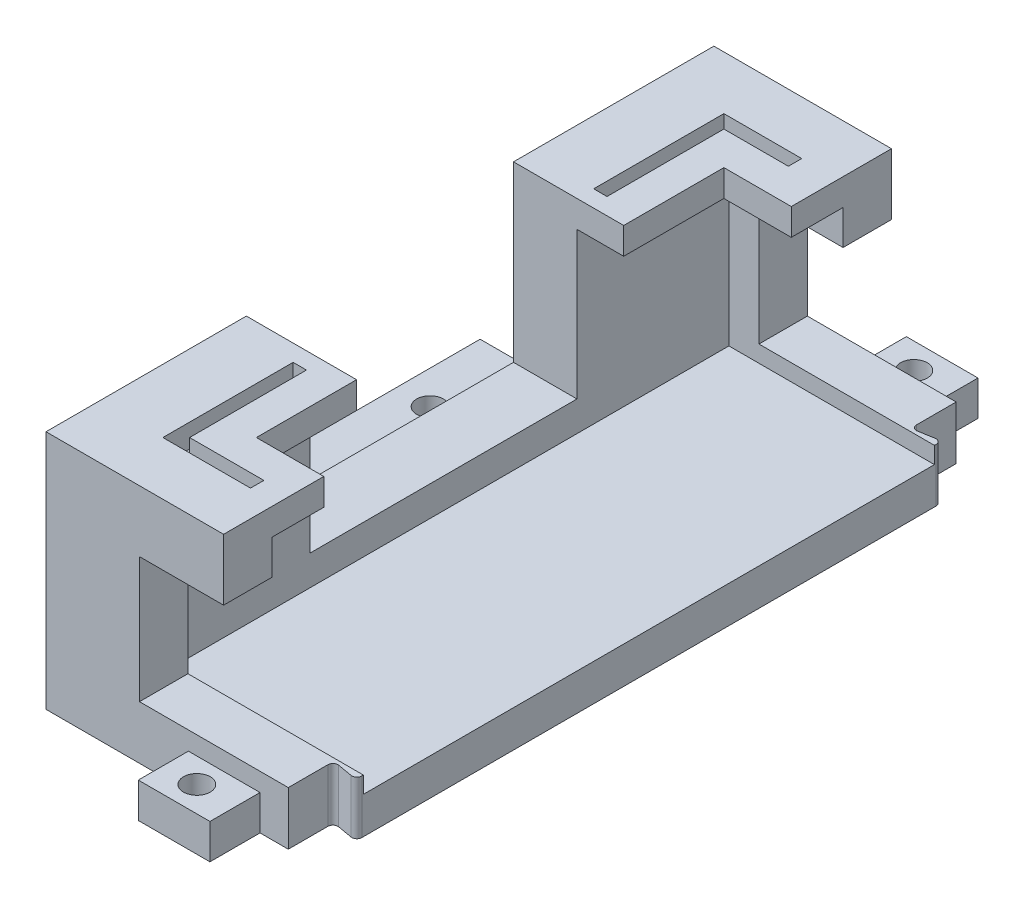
ISO-10303-21;
HEADER;
FILE_DESCRIPTION(('STEP AP214'),'2;1');
FILE_NAME('part.step','',(''),(''),'','','');
FILE_SCHEMA(('AUTOMOTIVE_DESIGN { 1 0 10303 214 1 1 1 1 }'));
ENDSEC;
DATA;
#1=APPLICATION_CONTEXT('core data for automotive mechanical design processes');
#2=APPLICATION_PROTOCOL_DEFINITION('international standard','automotive_design',2000,#1);
#3=PRODUCT_CONTEXT('',#1,'mechanical');
#4=PRODUCT('Part','Part','',(#3));
#5=PRODUCT_RELATED_PRODUCT_CATEGORY('part','',(#4));
#6=PRODUCT_DEFINITION_FORMATION('','',#4);
#7=PRODUCT_DEFINITION_CONTEXT('part definition',#1,'design');
#8=PRODUCT_DEFINITION('design','',#6,#7);
#9=PRODUCT_DEFINITION_SHAPE('','',#8);
#10=(LENGTH_UNIT() NAMED_UNIT(*) SI_UNIT(.MILLI.,.METRE.));
#11=(NAMED_UNIT(*) PLANE_ANGLE_UNIT() SI_UNIT($,.RADIAN.));
#12=(NAMED_UNIT(*) SI_UNIT($,.STERADIAN.) SOLID_ANGLE_UNIT());
#13=UNCERTAINTY_MEASURE_WITH_UNIT(LENGTH_MEASURE(1.E-05),#10,'distance_accuracy_value','');
#14=(GEOMETRIC_REPRESENTATION_CONTEXT(3) GLOBAL_UNCERTAINTY_ASSIGNED_CONTEXT((#13)) GLOBAL_UNIT_ASSIGNED_CONTEXT((#10,
#11,#12)) REPRESENTATION_CONTEXT('',''));
#15=CARTESIAN_POINT('',(0.,0.,0.));
#16=DIRECTION('',(0.,0.,1.));
#17=DIRECTION('',(1.,0.,0.));
#18=AXIS2_PLACEMENT_3D('',#15,#16,#17);
#19=CARTESIAN_POINT('',(-146.5,15.9949525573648,-100.));
#20=DIRECTION('',(0.,-1.,0.));
#21=DIRECTION('',(0.,0.,-1.));
#22=AXIS2_PLACEMENT_3D('',#19,#20,#21);
#23=PLANE('',#22);
#24=DIRECTION('',(0.,0.,1.));
#25=VECTOR('',#24,1.);
#26=CARTESIAN_POINT('',(-111.95,15.9949525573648,-97.6606158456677));
#27=LINE('',#26,#25);
#28=CARTESIAN_POINT('',(-111.95,15.9949525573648,-100.));
#29=VERTEX_POINT('',#28);
#30=CARTESIAN_POINT('',(-111.95,15.9949525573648,-88.1270145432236));
#31=VERTEX_POINT('',#30);
#32=EDGE_CURVE('E1040',#29,#31,#27,.T.);
#33=ORIENTED_EDGE('',*,*,#32,.F.);
#34=DIRECTION('',(1.,0.,0.));
#35=VECTOR('',#34,1.);
#36=CARTESIAN_POINT('',(-146.5,15.9949525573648,-100.));
#37=LINE('',#36,#35);
#38=CARTESIAN_POINT('',(-156.5,15.9949525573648,-100.));
#39=VERTEX_POINT('',#38);
#40=EDGE_CURVE('E430',#39,#29,#37,.T.);
#41=ORIENTED_EDGE('',*,*,#40,.F.);
#42=DIRECTION('',(0.,0.,1.));
#43=VECTOR('',#42,1.);
#44=CARTESIAN_POINT('',(-156.5,15.9949525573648,-100.));
#45=LINE('',#44,#43);
#46=CARTESIAN_POINT('',(-156.5,15.9949525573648,-85.5));
#47=VERTEX_POINT('',#46);
#48=EDGE_CURVE('E534',#39,#47,#45,.T.);
#49=ORIENTED_EDGE('',*,*,#48,.T.);
#50=DIRECTION('',(-1.,0.,0.));
#51=VECTOR('',#50,1.);
#52=CARTESIAN_POINT('',(-146.5,15.9949525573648,-85.5));
#53=LINE('',#52,#51);
#54=CARTESIAN_POINT('',(-103.95,15.9949525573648,-85.5));
#55=VERTEX_POINT('',#54);
#56=EDGE_CURVE('E11',#55,#47,#53,.T.);
#57=ORIENTED_EDGE('',*,*,#56,.F.);
#58=DIRECTION('',(0.,0.,1.));
#59=VECTOR('',#58,1.);
#60=CARTESIAN_POINT('',(-103.95,15.9949525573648,-161.504576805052));
#61=LINE('',#60,#59);
#62=CARTESIAN_POINT('',(-103.95,15.9949525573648,-85.9623696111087));
#63=VERTEX_POINT('',#62);
#64=EDGE_CURVE('E1031',#63,#55,#61,.T.);
#65=ORIENTED_EDGE('',*,*,#64,.F.);
#66=CARTESIAN_POINT('',(-105.45,15.9949525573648,-85.9623696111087));
#67=DIRECTION('',(0.,-1.,0.));
#68=DIRECTION('',(0.,0.,-1.));
#69=AXIS2_PLACEMENT_3D('',#66,#67,#68);
#70=CIRCLE('',#69,1.5);
#71=CARTESIAN_POINT('',(-105.7104722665,15.9949525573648,-87.439581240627));
#72=VERTEX_POINT('',#71);
#73=EDGE_CURVE('E1047',#63,#72,#70,.F.);
#74=ORIENTED_EDGE('',*,*,#73,.T.);
#75=DIRECTION('',(0.984807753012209,0.,-0.173648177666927));
#76=VECTOR('',#75,1.);
#77=CARTESIAN_POINT('',(-111.95,15.9949525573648,-86.3393841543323));
#78=LINE('',#77,#76);
#79=CARTESIAN_POINT('',(-110.1895277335,15.9949525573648,-86.6498029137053));
#80=VERTEX_POINT('',#79);
#81=EDGE_CURVE('E1043',#80,#72,#78,.T.);
#82=ORIENTED_EDGE('',*,*,#81,.F.);
#83=CARTESIAN_POINT('',(-110.45,15.9949525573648,-88.1270145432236));
#84=DIRECTION('',(0.,-1.,0.));
#85=DIRECTION('',(0.,0.,-1.));
#86=AXIS2_PLACEMENT_3D('',#83,#84,#85);
#87=CIRCLE('',#86,1.5);
#88=EDGE_CURVE('E1036',#31,#80,#87,.F.);
#89=ORIENTED_EDGE('',*,*,#88,.F.);
#90=EDGE_LOOP('',(#33,#41,#49,#57,#65,#74,#82,#89));
#91=FACE_BOUND('',#90,.T.);
#92=ADVANCED_FACE('F45',(#91),#23,.F.);
#93=CARTESIAN_POINT('',(-184.5,20.,-100.));
#94=DIRECTION('',(0.,0.,1.));
#95=DIRECTION('',(1.,0.,0.));
#96=AXIS2_PLACEMENT_3D('',#93,#94,#95);
#97=PLANE('',#96);
#98=DIRECTION('',(0.,1.,0.));
#99=VECTOR('',#98,1.);
#100=CARTESIAN_POINT('',(-111.95,0.,-100.));
#101=LINE('',#100,#99);
#102=CARTESIAN_POINT('',(-111.95,0.,-100.));
#103=VERTEX_POINT('',#102);
#104=EDGE_CURVE('E413',#103,#29,#101,.T.);
#105=ORIENTED_EDGE('',*,*,#104,.F.);
#106=DIRECTION('',(-1.,0.,0.));
#107=VECTOR('',#106,1.);
#108=CARTESIAN_POINT('',(-184.5,0.,-100.));
#109=LINE('',#108,#107);
#110=CARTESIAN_POINT('',(-120.407474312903,0.,-100.));
#111=VERTEX_POINT('',#110);
#112=EDGE_CURVE('E427',#103,#111,#109,.T.);
#113=ORIENTED_EDGE('',*,*,#112,.T.);
#114=DIRECTION('',(0.,1.,0.));
#115=VECTOR('',#114,1.);
#116=CARTESIAN_POINT('',(-120.407474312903,0.,-100.));
#117=LINE('',#116,#115);
#118=CARTESIAN_POINT('',(-120.407474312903,10.4853435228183,-100.));
#119=VERTEX_POINT('',#118);
#120=EDGE_CURVE('E2148',#111,#119,#117,.T.);
#121=ORIENTED_EDGE('',*,*,#120,.T.);
#122=DIRECTION('',(-1.,0.,0.));
#123=VECTOR('',#122,1.);
#124=CARTESIAN_POINT('',(-141.861603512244,10.4853435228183,-100.));
#125=LINE('',#124,#123);
#126=CARTESIAN_POINT('',(-141.861603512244,10.4853435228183,-100.));
#127=VERTEX_POINT('',#126);
#128=EDGE_CURVE('E2162',#119,#127,#125,.T.);
#129=ORIENTED_EDGE('',*,*,#128,.T.);
#130=DIRECTION('',(0.,-1.,0.));
#131=VECTOR('',#130,1.);
#132=CARTESIAN_POINT('',(-141.861603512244,0.,-100.));
#133=LINE('',#132,#131);
#134=CARTESIAN_POINT('',(-141.861603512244,0.,-100.));
#135=VERTEX_POINT('',#134);
#136=EDGE_CURVE('E61',#127,#135,#133,.T.);
#137=ORIENTED_EDGE('',*,*,#136,.T.);
#138=CARTESIAN_POINT('',(-184.5,0.,-100.));
#139=VERTEX_POINT('',#138);
#140=EDGE_CURVE('E440',#135,#139,#109,.T.);
#141=ORIENTED_EDGE('',*,*,#140,.T.);
#142=DIRECTION('',(0.,-1.,0.));
#143=VECTOR('',#142,1.);
#144=CARTESIAN_POINT('',(-184.5,20.,-100.));
#145=LINE('',#144,#143);
#146=CARTESIAN_POINT('',(-184.5,72.,-100.));
#147=VERTEX_POINT('',#146);
#148=EDGE_CURVE('E460',#147,#139,#145,.T.);
#149=ORIENTED_EDGE('',*,*,#148,.F.);
#150=DIRECTION('',(-1.,0.,0.));
#151=VECTOR('',#150,1.);
#152=CARTESIAN_POINT('',(-115.5,72.,-100.));
#153=LINE('',#152,#151);
#154=CARTESIAN_POINT('',(-131.314467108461,72.,-100.));
#155=VERTEX_POINT('',#154);
#156=EDGE_CURVE('E793',#155,#147,#153,.T.);
#157=ORIENTED_EDGE('',*,*,#156,.F.);
#158=DIRECTION('',(0.,-1.,0.));
#159=VECTOR('',#158,1.);
#160=CARTESIAN_POINT('',(-131.314467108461,72.,-100.));
#161=LINE('',#160,#159);
#162=CARTESIAN_POINT('',(-131.314467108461,53.6124200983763,-100.));
#163=VERTEX_POINT('',#162);
#164=EDGE_CURVE('E575',#155,#163,#161,.T.);
#165=ORIENTED_EDGE('',*,*,#164,.T.);
#166=DIRECTION('',(-1.,0.,0.));
#167=VECTOR('',#166,1.);
#168=CARTESIAN_POINT('',(-184.5,53.6124200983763,-100.));
#169=LINE('',#168,#167);
#170=CARTESIAN_POINT('',(-156.5,53.6124200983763,-100.));
#171=VERTEX_POINT('',#170);
#172=EDGE_CURVE('E672',#163,#171,#169,.T.);
#173=ORIENTED_EDGE('',*,*,#172,.T.);
#174=DIRECTION('',(0.,-1.,0.));
#175=VECTOR('',#174,1.);
#176=CARTESIAN_POINT('',(-156.5,20.,-100.));
#177=LINE('',#176,#175);
#178=EDGE_CURVE('E676',#171,#39,#177,.T.);
#179=ORIENTED_EDGE('',*,*,#178,.T.);
#180=ORIENTED_EDGE('',*,*,#40,.T.);
#181=EDGE_LOOP('',(#105,#113,#121,#129,#137,#141,#149,#157,#165,#173,#179,#180));
#182=FACE_BOUND('',#181,.T.);
#183=ADVANCED_FACE('F425',(#182),#97,.F.);
#184=CARTESIAN_POINT('',(0.,0.,0.));
#185=DIRECTION('',(0.,-1.,0.));
#186=DIRECTION('',(0.,0.,-1.));
#187=AXIS2_PLACEMENT_3D('',#184,#185,#186);
#188=PLANE('',#187);
#189=CARTESIAN_POINT('',(-131.966394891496,0.,-107.358810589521));
#190=DIRECTION('',(0.,-1.,0.));
#191=DIRECTION('',(0.,0.,-1.));
#192=AXIS2_PLACEMENT_3D('',#189,#190,#191);
#193=CIRCLE('',#192,3.99999999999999);
#194=CARTESIAN_POINT('',(-131.966394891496,0.,-111.358810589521));
#195=VERTEX_POINT('',#194);
#196=EDGE_CURVE('E2135',#195,#195,#193,.F.);
#197=ORIENTED_EDGE('',*,*,#196,.T.);
#198=EDGE_LOOP('',(#197));
#199=FACE_BOUND('',#198,.T.);
#200=CARTESIAN_POINT('',(-131.966394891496,0.,107.358810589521));
#201=DIRECTION('',(0.,-1.,0.));
#202=DIRECTION('',(0.,0.,-1.));
#203=AXIS2_PLACEMENT_3D('',#200,#201,#202);
#204=CIRCLE('',#203,3.99999999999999);
#205=CARTESIAN_POINT('',(-131.966394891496,0.,103.358810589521));
#206=VERTEX_POINT('',#205);
#207=EDGE_CURVE('E1191',#206,#206,#204,.T.);
#208=ORIENTED_EDGE('',*,*,#207,.F.);
#209=EDGE_LOOP('',(#208));
#210=FACE_BOUND('',#209,.T.);
#211=CARTESIAN_POINT('',(-194.5,0.,25.));
#212=DIRECTION('',(0.,-1.,0.));
#213=DIRECTION('',(0.,0.,-1.));
#214=AXIS2_PLACEMENT_3D('',#211,#212,#213);
#215=CIRCLE('',#214,3.99999999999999);
#216=CARTESIAN_POINT('',(-194.5,0.,29.));
#217=VERTEX_POINT('',#216);
#218=EDGE_CURVE('E607',#217,#217,#215,.T.);
#219=ORIENTED_EDGE('',*,*,#218,.F.);
#220=EDGE_LOOP('',(#219));
#221=FACE_BOUND('',#220,.T.);
#222=CARTESIAN_POINT('',(-194.5,0.,-25.));
#223=DIRECTION('',(0.,1.,0.));
#224=DIRECTION('',(0.,0.,1.));
#225=AXIS2_PLACEMENT_3D('',#222,#223,#224);
#226=CIRCLE('',#225,3.99999999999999);
#227=CARTESIAN_POINT('',(-194.5,0.,-21.));
#228=VERTEX_POINT('',#227);
#229=EDGE_CURVE('E630',#228,#228,#226,.T.);
#230=ORIENTED_EDGE('',*,*,#229,.T.);
#231=EDGE_LOOP('',(#230));
#232=FACE_BOUND('',#231,.T.);
#233=ORIENTED_EDGE('',*,*,#112,.F.);
#234=DIRECTION('',(0.,0.,1.));
#235=VECTOR('',#234,1.);
#236=CARTESIAN_POINT('',(-111.95,0.,-97.6606158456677));
#237=LINE('',#236,#235);
#238=CARTESIAN_POINT('',(-111.95,0.,-88.1270145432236));
#239=VERTEX_POINT('',#238);
#240=EDGE_CURVE('E410',#103,#239,#237,.T.);
#241=ORIENTED_EDGE('',*,*,#240,.T.);
#242=CARTESIAN_POINT('',(-110.45,0.,-88.1270145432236));
#243=DIRECTION('',(0.,-1.,0.));
#244=DIRECTION('',(0.,0.,-1.));
#245=AXIS2_PLACEMENT_3D('',#242,#243,#244);
#246=CIRCLE('',#245,1.5);
#247=CARTESIAN_POINT('',(-110.1895277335,0.,-86.6498029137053));
#248=VERTEX_POINT('',#247);
#249=EDGE_CURVE('E503',#239,#248,#246,.F.);
#250=ORIENTED_EDGE('',*,*,#249,.T.);
#251=DIRECTION('',(0.984807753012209,0.,-0.173648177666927));
#252=VECTOR('',#251,1.);
#253=CARTESIAN_POINT('',(-111.95,0.,-86.3393841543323));
#254=LINE('',#253,#252);
#255=CARTESIAN_POINT('',(-105.7104722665,0.,-87.439581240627));
#256=VERTEX_POINT('',#255);
#257=EDGE_CURVE('E421',#248,#256,#254,.T.);
#258=ORIENTED_EDGE('',*,*,#257,.T.);
#259=CARTESIAN_POINT('',(-105.45,0.,-85.9623696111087));
#260=DIRECTION('',(0.,-1.,0.));
#261=DIRECTION('',(0.,0.,-1.));
#262=AXIS2_PLACEMENT_3D('',#259,#260,#261);
#263=CIRCLE('',#262,1.5);
#264=CARTESIAN_POINT('',(-103.95,0.,-85.9623696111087));
#265=VERTEX_POINT('',#264);
#266=EDGE_CURVE('E475',#256,#265,#263,.T.);
#267=ORIENTED_EDGE('',*,*,#266,.T.);
#268=DIRECTION('',(0.,0.,-1.));
#269=VECTOR('',#268,1.);
#270=CARTESIAN_POINT('',(-103.95,0.,0.));
#271=LINE('',#270,#269);
#272=CARTESIAN_POINT('',(-103.95,0.,85.9623696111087));
#273=VERTEX_POINT('',#272);
#274=EDGE_CURVE('E679',#273,#265,#271,.T.);
#275=ORIENTED_EDGE('',*,*,#274,.F.);
#276=CARTESIAN_POINT('',(-105.45,0.,85.9623696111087));
#277=DIRECTION('',(0.,-1.,0.));
#278=DIRECTION('',(0.,0.,-1.));
#279=AXIS2_PLACEMENT_3D('',#276,#277,#278);
#280=CIRCLE('',#279,1.5);
#281=CARTESIAN_POINT('',(-105.7104722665,0.,87.439581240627));
#282=VERTEX_POINT('',#281);
#283=EDGE_CURVE('E472',#273,#282,#280,.T.);
#284=ORIENTED_EDGE('',*,*,#283,.T.);
#285=DIRECTION('',(-0.984807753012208,0.,-0.173648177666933));
#286=VECTOR('',#285,1.);
#287=CARTESIAN_POINT('',(-103.95,0.,87.75));
#288=LINE('',#287,#286);
#289=CARTESIAN_POINT('',(-110.1895277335,0.,86.6498029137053));
#290=VERTEX_POINT('',#289);
#291=EDGE_CURVE('E596',#282,#290,#288,.T.);
#292=ORIENTED_EDGE('',*,*,#291,.T.);
#293=CARTESIAN_POINT('',(-110.45,0.,88.1270145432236));
#294=DIRECTION('',(0.,-1.,0.));
#295=DIRECTION('',(0.,0.,-1.));
#296=AXIS2_PLACEMENT_3D('',#293,#294,#295);
#297=CIRCLE('',#296,1.5);
#298=CARTESIAN_POINT('',(-111.95,0.,88.1270145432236));
#299=VERTEX_POINT('',#298);
#300=EDGE_CURVE('E506',#290,#299,#297,.F.);
#301=ORIENTED_EDGE('',*,*,#300,.T.);
#302=DIRECTION('',(0.,0.,1.));
#303=VECTOR('',#302,1.);
#304=CARTESIAN_POINT('',(-111.95,0.,86.3393841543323));
#305=LINE('',#304,#303);
#306=CARTESIAN_POINT('',(-111.95,0.,100.));
#307=VERTEX_POINT('',#306);
#308=EDGE_CURVE('E422',#299,#307,#305,.T.);
#309=ORIENTED_EDGE('',*,*,#308,.T.);
#310=DIRECTION('',(1.,0.,0.));
#311=VECTOR('',#310,1.);
#312=CARTESIAN_POINT('',(-184.5,0.,100.));
#313=LINE('',#312,#311);
#314=CARTESIAN_POINT('',(-120.407474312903,0.,100.));
#315=VERTEX_POINT('',#314);
#316=EDGE_CURVE('E452',#315,#307,#313,.T.);
#317=ORIENTED_EDGE('',*,*,#316,.F.);
#318=DIRECTION('',(0.,0.,-1.));
#319=VECTOR('',#318,1.);
#320=CARTESIAN_POINT('',(-120.407474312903,0.,115.));
#321=LINE('',#320,#319);
#322=CARTESIAN_POINT('',(-120.407474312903,0.,115.));
#323=VERTEX_POINT('',#322);
#324=EDGE_CURVE('E908',#323,#315,#321,.T.);
#325=ORIENTED_EDGE('',*,*,#324,.F.);
#326=DIRECTION('',(1.,0.,0.));
#327=VECTOR('',#326,1.);
#328=CARTESIAN_POINT('',(-141.861603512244,0.,115.));
#329=LINE('',#328,#327);
#330=CARTESIAN_POINT('',(-141.861603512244,0.,115.));
#331=VERTEX_POINT('',#330);
#332=EDGE_CURVE('E1204',#331,#323,#329,.T.);
#333=ORIENTED_EDGE('',*,*,#332,.F.);
#334=DIRECTION('',(0.,0.,-1.));
#335=VECTOR('',#334,1.);
#336=CARTESIAN_POINT('',(-141.861603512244,0.,115.));
#337=LINE('',#336,#335);
#338=CARTESIAN_POINT('',(-141.861603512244,0.,100.));
#339=VERTEX_POINT('',#338);
#340=EDGE_CURVE('E919',#331,#339,#337,.T.);
#341=ORIENTED_EDGE('',*,*,#340,.T.);
#342=CARTESIAN_POINT('',(-184.5,0.,100.));
#343=VERTEX_POINT('',#342);
#344=EDGE_CURVE('E453',#343,#339,#313,.T.);
#345=ORIENTED_EDGE('',*,*,#344,.F.);
#346=DIRECTION('',(0.,0.,1.));
#347=VECTOR('',#346,1.);
#348=CARTESIAN_POINT('',(-184.5,0.,100.));
#349=LINE('',#348,#347);
#350=CARTESIAN_POINT('',(-184.5,0.,50.));
#351=VERTEX_POINT('',#350);
#352=EDGE_CURVE('E439',#351,#343,#349,.T.);
#353=ORIENTED_EDGE('',*,*,#352,.F.);
#354=DIRECTION('',(1.,0.,0.));
#355=VECTOR('',#354,1.);
#356=CARTESIAN_POINT('',(-204.5,0.,50.));
#357=LINE('',#356,#355);
#358=CARTESIAN_POINT('',(-204.5,0.,50.));
#359=VERTEX_POINT('',#358);
#360=EDGE_CURVE('E626',#359,#351,#357,.T.);
#361=ORIENTED_EDGE('',*,*,#360,.F.);
#362=DIRECTION('',(0.,0.,1.));
#363=VECTOR('',#362,1.);
#364=CARTESIAN_POINT('',(-204.5,0.,0.));
#365=LINE('',#364,#363);
#366=CARTESIAN_POINT('',(-204.5,0.,-50.));
#367=VERTEX_POINT('',#366);
#368=EDGE_CURVE('E645',#367,#359,#365,.T.);
#369=ORIENTED_EDGE('',*,*,#368,.F.);
#370=DIRECTION('',(1.,0.,0.));
#371=VECTOR('',#370,1.);
#372=CARTESIAN_POINT('',(-204.5,0.,-50.));
#373=LINE('',#372,#371);
#374=CARTESIAN_POINT('',(-184.5,0.,-50.));
#375=VERTEX_POINT('',#374);
#376=EDGE_CURVE('E648',#367,#375,#373,.T.);
#377=ORIENTED_EDGE('',*,*,#376,.T.);
#378=EDGE_CURVE('E444',#139,#375,#349,.T.);
#379=ORIENTED_EDGE('',*,*,#378,.F.);
#380=ORIENTED_EDGE('',*,*,#140,.F.);
#381=DIRECTION('',(0.,0.,1.));
#382=VECTOR('',#381,1.);
#383=CARTESIAN_POINT('',(-141.861603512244,0.,-115.));
#384=LINE('',#383,#382);
#385=CARTESIAN_POINT('',(-141.861603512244,0.,-115.));
#386=VERTEX_POINT('',#385);
#387=EDGE_CURVE('E2159',#386,#135,#384,.T.);
#388=ORIENTED_EDGE('',*,*,#387,.F.);
#389=DIRECTION('',(1.,0.,0.));
#390=VECTOR('',#389,1.);
#391=CARTESIAN_POINT('',(-141.861603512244,0.,-115.));
#392=LINE('',#391,#390);
#393=CARTESIAN_POINT('',(-120.407474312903,0.,-115.));
#394=VERTEX_POINT('',#393);
#395=EDGE_CURVE('E2156',#386,#394,#392,.T.);
#396=ORIENTED_EDGE('',*,*,#395,.T.);
#397=DIRECTION('',(0.,0.,1.));
#398=VECTOR('',#397,1.);
#399=CARTESIAN_POINT('',(-120.407474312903,0.,-115.));
#400=LINE('',#399,#398);
#401=EDGE_CURVE('E436',#394,#111,#400,.T.);
#402=ORIENTED_EDGE('',*,*,#401,.T.);
#403=EDGE_LOOP('',(#233,#241,#250,#258,#267,#275,#284,#292,#301,#309,#317,#325,#333,#341,#345,
#353,#361,#369,#377,#379,#380,#388,#396,#402));
#404=FACE_BOUND('',#403,.T.);
#405=ADVANCED_FACE('F434',(#199,#210,#221,#232,#404),#188,.T.);
#406=CARTESIAN_POINT('',(-184.5,20.,100.));
#407=DIRECTION('',(0.,0.,-1.));
#408=DIRECTION('',(-1.,0.,0.));
#409=AXIS2_PLACEMENT_3D('',#406,#407,#408);
#410=PLANE('',#409);
#411=ORIENTED_EDGE('',*,*,#316,.T.);
#412=DIRECTION('',(0.,1.,0.));
#413=VECTOR('',#412,1.);
#414=CARTESIAN_POINT('',(-111.95,0.,100.));
#415=LINE('',#414,#413);
#416=CARTESIAN_POINT('',(-111.95,15.9949525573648,100.));
#417=VERTEX_POINT('',#416);
#418=EDGE_CURVE('E903',#307,#417,#415,.T.);
#419=ORIENTED_EDGE('',*,*,#418,.T.);
#420=DIRECTION('',(-1.,0.,0.));
#421=VECTOR('',#420,1.);
#422=CARTESIAN_POINT('',(-184.5,15.9949525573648,100.));
#423=LINE('',#422,#421);
#424=CARTESIAN_POINT('',(-156.5,15.9949525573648,100.));
#425=VERTEX_POINT('',#424);
#426=EDGE_CURVE('E509',#417,#425,#423,.T.);
#427=ORIENTED_EDGE('',*,*,#426,.T.);
#428=DIRECTION('',(0.,1.,0.));
#429=VECTOR('',#428,1.);
#430=CARTESIAN_POINT('',(-156.5,53.6124200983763,100.));
#431=LINE('',#430,#429);
#432=CARTESIAN_POINT('',(-156.5,53.6124200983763,100.));
#433=VERTEX_POINT('',#432);
#434=EDGE_CURVE('E532',#425,#433,#431,.T.);
#435=ORIENTED_EDGE('',*,*,#434,.T.);
#436=DIRECTION('',(1.,0.,0.));
#437=VECTOR('',#436,1.);
#438=CARTESIAN_POINT('',(-115.5,53.6124200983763,100.));
#439=LINE('',#438,#437);
#440=CARTESIAN_POINT('',(-131.314467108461,53.6124200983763,100.));
#441=VERTEX_POINT('',#440);
#442=EDGE_CURVE('E664',#433,#441,#439,.T.);
#443=ORIENTED_EDGE('',*,*,#442,.T.);
#444=DIRECTION('',(0.,-1.,0.));
#445=VECTOR('',#444,1.);
#446=CARTESIAN_POINT('',(-131.314467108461,72.,100.));
#447=LINE('',#446,#445);
#448=CARTESIAN_POINT('',(-131.314467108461,72.,100.));
#449=VERTEX_POINT('',#448);
#450=EDGE_CURVE('E574',#449,#441,#447,.T.);
#451=ORIENTED_EDGE('',*,*,#450,.F.);
#452=DIRECTION('',(-1.,0.,0.));
#453=VECTOR('',#452,1.);
#454=CARTESIAN_POINT('',(-115.5,72.,100.));
#455=LINE('',#454,#453);
#456=CARTESIAN_POINT('',(-184.5,72.,100.));
#457=VERTEX_POINT('',#456);
#458=EDGE_CURVE('E729',#449,#457,#455,.T.);
#459=ORIENTED_EDGE('',*,*,#458,.T.);
#460=DIRECTION('',(0.,-1.,0.));
#461=VECTOR('',#460,1.);
#462=CARTESIAN_POINT('',(-184.5,20.,100.));
#463=LINE('',#462,#461);
#464=EDGE_CURVE('E456',#457,#343,#463,.T.);
#465=ORIENTED_EDGE('',*,*,#464,.T.);
#466=ORIENTED_EDGE('',*,*,#344,.T.);
#467=DIRECTION('',(0.,-1.,0.));
#468=VECTOR('',#467,1.);
#469=CARTESIAN_POINT('',(-141.861603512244,0.,100.));
#470=LINE('',#469,#468);
#471=CARTESIAN_POINT('',(-141.861603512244,10.4853435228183,100.));
#472=VERTEX_POINT('',#471);
#473=EDGE_CURVE('E69',#472,#339,#470,.T.);
#474=ORIENTED_EDGE('',*,*,#473,.F.);
#475=DIRECTION('',(-1.,0.,0.));
#476=VECTOR('',#475,1.);
#477=CARTESIAN_POINT('',(-141.861603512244,10.4853435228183,100.));
#478=LINE('',#477,#476);
#479=CARTESIAN_POINT('',(-120.407474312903,10.4853435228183,100.));
#480=VERTEX_POINT('',#479);
#481=EDGE_CURVE('E1205',#480,#472,#478,.T.);
#482=ORIENTED_EDGE('',*,*,#481,.F.);
#483=DIRECTION('',(0.,1.,0.));
#484=VECTOR('',#483,1.);
#485=CARTESIAN_POINT('',(-120.407474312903,0.,100.));
#486=LINE('',#485,#484);
#487=EDGE_CURVE('E915',#315,#480,#486,.T.);
#488=ORIENTED_EDGE('',*,*,#487,.F.);
#489=EDGE_LOOP('',(#411,#419,#427,#435,#443,#451,#459,#465,#466,#474,#482,#488));
#490=FACE_BOUND('',#489,.T.);
#491=ADVANCED_FACE('F1127',(#490),#410,.F.);
#492=CARTESIAN_POINT('',(-103.95,-37.,-161.504576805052));
#493=DIRECTION('',(-1.,0.,0.));
#494=DIRECTION('',(0.,0.,1.));
#495=AXIS2_PLACEMENT_3D('',#492,#493,#494);
#496=PLANE('',#495);
#497=DIRECTION('',(0.,-1.,0.));
#498=VECTOR('',#497,1.);
#499=CARTESIAN_POINT('',(-103.95,11.,-85.5));
#500=LINE('',#499,#498);
#501=CARTESIAN_POINT('',(-103.95,11.,-85.5));
#502=VERTEX_POINT('',#501);
#503=EDGE_CURVE('E931',#55,#502,#500,.T.);
#504=ORIENTED_EDGE('',*,*,#503,.T.);
#505=DIRECTION('',(0.,0.,1.));
#506=VECTOR('',#505,1.);
#507=CARTESIAN_POINT('',(-103.95,11.,0.));
#508=LINE('',#507,#506);
#509=CARTESIAN_POINT('',(-103.95,11.,85.5));
#510=VERTEX_POINT('',#509);
#511=EDGE_CURVE('E464',#502,#510,#508,.T.);
#512=ORIENTED_EDGE('',*,*,#511,.T.);
#513=DIRECTION('',(0.,-1.,0.));
#514=VECTOR('',#513,1.);
#515=CARTESIAN_POINT('',(-103.95,11.,85.5));
#516=LINE('',#515,#514);
#517=CARTESIAN_POINT('',(-103.95,15.9949525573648,85.5));
#518=VERTEX_POINT('',#517);
#519=EDGE_CURVE('E956',#518,#510,#516,.T.);
#520=ORIENTED_EDGE('',*,*,#519,.F.);
#521=CARTESIAN_POINT('',(-103.95,15.9949525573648,85.9623696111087));
#522=VERTEX_POINT('',#521);
#523=EDGE_CURVE('E522',#518,#522,#61,.T.);
#524=ORIENTED_EDGE('',*,*,#523,.T.);
#525=DIRECTION('',(0.,1.,0.));
#526=VECTOR('',#525,1.);
#527=CARTESIAN_POINT('',(-103.95,-37.,85.9623696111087));
#528=LINE('',#527,#526);
#529=EDGE_CURVE('E478',#522,#273,#528,.F.);
#530=ORIENTED_EDGE('',*,*,#529,.T.);
#531=ORIENTED_EDGE('',*,*,#274,.T.);
#532=DIRECTION('',(0.,1.,0.));
#533=VECTOR('',#532,1.);
#534=CARTESIAN_POINT('',(-103.95,-37.,-85.9623696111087));
#535=LINE('',#534,#533);
#536=EDGE_CURVE('E481',#265,#63,#535,.T.);
#537=ORIENTED_EDGE('',*,*,#536,.T.);
#538=ORIENTED_EDGE('',*,*,#64,.T.);
#539=EDGE_LOOP('',(#504,#512,#520,#524,#530,#531,#537,#538));
#540=FACE_BOUND('',#539,.T.);
#541=ADVANCED_FACE('F1170',(#540),#496,.F.);
#542=CARTESIAN_POINT('',(-115.5,53.6124200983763,100.));
#543=DIRECTION('',(0.,1.,0.));
#544=DIRECTION('',(0.,0.,1.));
#545=AXIS2_PLACEMENT_3D('',#542,#543,#544);
#546=PLANE('',#545);
#547=DIRECTION('',(1.,0.,0.));
#548=VECTOR('',#547,1.);
#549=CARTESIAN_POINT('',(-115.5,53.6124200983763,-85.5));
#550=LINE('',#549,#548);
#551=CARTESIAN_POINT('',(-156.5,53.6124200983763,-85.5));
#552=VERTEX_POINT('',#551);
#553=CARTESIAN_POINT('',(-131.314467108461,53.6124200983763,-85.5));
#554=VERTEX_POINT('',#553);
#555=EDGE_CURVE('E949',#552,#554,#550,.T.);
#556=ORIENTED_EDGE('',*,*,#555,.F.);
#557=DIRECTION('',(0.,0.,-1.));
#558=VECTOR('',#557,1.);
#559=CARTESIAN_POINT('',(-156.5,53.6124200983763,100.));
#560=LINE('',#559,#558);
#561=EDGE_CURVE('E668',#552,#171,#560,.T.);
#562=ORIENTED_EDGE('',*,*,#561,.T.);
#563=ORIENTED_EDGE('',*,*,#172,.F.);
#564=DIRECTION('',(0.,0.,1.));
#565=VECTOR('',#564,1.);
#566=CARTESIAN_POINT('',(-131.314467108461,53.6124200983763,-100.));
#567=LINE('',#566,#565);
#568=EDGE_CURVE('E583',#163,#554,#567,.T.);
#569=ORIENTED_EDGE('',*,*,#568,.T.);
#570=EDGE_LOOP('',(#556,#562,#563,#569));
#571=FACE_BOUND('',#570,.T.);
#572=ADVANCED_FACE('F1150',(#571),#546,.F.);
#573=CARTESIAN_POINT('',(-156.5,53.6124200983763,100.));
#574=DIRECTION('',(-1.,0.,0.));
#575=DIRECTION('',(0.,0.,1.));
#576=AXIS2_PLACEMENT_3D('',#573,#574,#575);
#577=PLANE('',#576);
#578=DIRECTION('',(0.,1.,0.));
#579=VECTOR('',#578,1.);
#580=CARTESIAN_POINT('',(-156.5,53.6124200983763,-85.5));
#581=LINE('',#580,#579);
#582=EDGE_CURVE('E940',#47,#552,#581,.T.);
#583=ORIENTED_EDGE('',*,*,#582,.F.);
#584=ORIENTED_EDGE('',*,*,#48,.F.);
#585=ORIENTED_EDGE('',*,*,#178,.F.);
#586=ORIENTED_EDGE('',*,*,#561,.F.);
#587=EDGE_LOOP('',(#583,#584,#585,#586));
#588=FACE_BOUND('',#587,.T.);
#589=ADVANCED_FACE('F1155',(#588),#577,.F.);
#590=CARTESIAN_POINT('',(-131.314467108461,72.,-100.));
#591=DIRECTION('',(-1.,0.,0.));
#592=DIRECTION('',(0.,0.,1.));
#593=AXIS2_PLACEMENT_3D('',#590,#591,#592);
#594=PLANE('',#593);
#595=DIRECTION('',(0.,0.,-1.));
#596=VECTOR('',#595,1.);
#597=CARTESIAN_POINT('',(-131.314467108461,64.,-70.));
#598=LINE('',#597,#596);
#599=CARTESIAN_POINT('',(-131.314467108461,64.,-70.));
#600=VERTEX_POINT('',#599);
#601=CARTESIAN_POINT('',(-131.314467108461,64.,-85.5));
#602=VERTEX_POINT('',#601);
#603=EDGE_CURVE('E982',#600,#602,#598,.T.);
#604=ORIENTED_EDGE('',*,*,#603,.T.);
#605=DIRECTION('',(0.,1.,0.));
#606=VECTOR('',#605,1.);
#607=CARTESIAN_POINT('',(-131.314467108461,72.,-85.5));
#608=LINE('',#607,#606);
#609=EDGE_CURVE('E952',#554,#602,#608,.T.);
#610=ORIENTED_EDGE('',*,*,#609,.F.);
#611=ORIENTED_EDGE('',*,*,#568,.F.);
#612=ORIENTED_EDGE('',*,*,#164,.F.);
#613=DIRECTION('',(0.,0.,1.));
#614=VECTOR('',#613,1.);
#615=CARTESIAN_POINT('',(-131.314467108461,72.,-100.));
#616=LINE('',#615,#614);
#617=CARTESIAN_POINT('',(-131.314467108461,72.,-70.));
#618=VERTEX_POINT('',#617);
#619=EDGE_CURVE('E588',#155,#618,#616,.T.);
#620=ORIENTED_EDGE('',*,*,#619,.T.);
#621=DIRECTION('',(0.,1.,0.));
#622=VECTOR('',#621,1.);
#623=CARTESIAN_POINT('',(-131.314467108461,65.,-70.));
#624=LINE('',#623,#622);
#625=EDGE_CURVE('E593',#600,#618,#624,.T.);
#626=ORIENTED_EDGE('',*,*,#625,.F.);
#627=EDGE_LOOP('',(#604,#610,#611,#612,#620,#626));
#628=FACE_BOUND('',#627,.T.);
#629=ADVANCED_FACE('F1534',(#628),#594,.F.);
#630=CARTESIAN_POINT('',(-165.5,32.,84.));
#631=DIRECTION('',(-1.,0.,0.));
#632=DIRECTION('',(0.,0.,1.));
#633=AXIS2_PLACEMENT_3D('',#630,#631,#632);
#634=PLANE('',#633);
#635=DIRECTION('',(0.,0.,1.));
#636=VECTOR('',#635,1.);
#637=CARTESIAN_POINT('',(-165.5,64.,-40.));
#638=LINE('',#637,#636);
#639=CARTESIAN_POINT('',(-165.5,64.,-85.5));
#640=VERTEX_POINT('',#639);
#641=CARTESIAN_POINT('',(-165.5,64.,-40.));
#642=VERTEX_POINT('',#641);
#643=EDGE_CURVE('E998',#640,#642,#638,.T.);
#644=ORIENTED_EDGE('',*,*,#643,.T.);
#645=DIRECTION('',(0.,-1.,0.));
#646=VECTOR('',#645,1.);
#647=CARTESIAN_POINT('',(-165.5,32.,-40.));
#648=LINE('',#647,#646);
#649=CARTESIAN_POINT('',(-165.5,20.,-40.));
#650=VERTEX_POINT('',#649);
#651=EDGE_CURVE('E540',#642,#650,#648,.T.);
#652=ORIENTED_EDGE('',*,*,#651,.T.);
#653=DIRECTION('',(0.,0.,1.));
#654=VECTOR('',#653,1.);
#655=CARTESIAN_POINT('',(-165.5,20.,-84.));
#656=LINE('',#655,#654);
#657=CARTESIAN_POINT('',(-165.5,20.,40.));
#658=VERTEX_POINT('',#657);
#659=EDGE_CURVE('E796',#650,#658,#656,.T.);
#660=ORIENTED_EDGE('',*,*,#659,.T.);
#661=DIRECTION('',(0.,1.,0.));
#662=VECTOR('',#661,1.);
#663=CARTESIAN_POINT('',(-165.5,32.,40.));
#664=LINE('',#663,#662);
#665=CARTESIAN_POINT('',(-165.5,64.,40.));
#666=VERTEX_POINT('',#665);
#667=EDGE_CURVE('E1075',#658,#666,#664,.T.);
#668=ORIENTED_EDGE('',*,*,#667,.T.);
#669=DIRECTION('',(0.,0.,-1.));
#670=VECTOR('',#669,1.);
#671=CARTESIAN_POINT('',(-165.5,64.,71.5));
#672=LINE('',#671,#670);
#673=CARTESIAN_POINT('',(-165.5,64.,85.5));
#674=VERTEX_POINT('',#673);
#675=EDGE_CURVE('E1008',#674,#666,#672,.T.);
#676=ORIENTED_EDGE('',*,*,#675,.F.);
#677=DIRECTION('',(0.,-1.,0.));
#678=VECTOR('',#677,1.);
#679=CARTESIAN_POINT('',(-165.5,11.,85.5));
#680=LINE('',#679,#678);
#681=CARTESIAN_POINT('',(-165.5,11.,85.5));
#682=VERTEX_POINT('',#681);
#683=EDGE_CURVE('E960',#674,#682,#680,.T.);
#684=ORIENTED_EDGE('',*,*,#683,.T.);
#685=DIRECTION('',(0.,0.,1.));
#686=VECTOR('',#685,1.);
#687=CARTESIAN_POINT('',(-165.5,11.,-84.));
#688=LINE('',#687,#686);
#689=CARTESIAN_POINT('',(-165.5,11.,-85.5));
#690=VERTEX_POINT('',#689);
#691=EDGE_CURVE('E797',#690,#682,#688,.T.);
#692=ORIENTED_EDGE('',*,*,#691,.F.);
#693=DIRECTION('',(0.,-1.,0.));
#694=VECTOR('',#693,1.);
#695=CARTESIAN_POINT('',(-165.5,11.,-85.5));
#696=LINE('',#695,#694);
#697=EDGE_CURVE('E936',#640,#690,#696,.T.);
#698=ORIENTED_EDGE('',*,*,#697,.F.);
#699=EDGE_LOOP('',(#644,#652,#660,#668,#676,#684,#692,#698));
#700=FACE_BOUND('',#699,.T.);
#701=ADVANCED_FACE('F1084',(#700),#634,.F.);
#702=DIRECTION('',(0.,1.,0.));
#703=VECTOR('',#702,1.);
#704=CARTESIAN_POINT('',(-165.5,65.,-45.));
#705=LINE('',#704,#703);
#706=CARTESIAN_POINT('',(-165.5,65.,-45.));
#707=VERTEX_POINT('',#706);
#708=CARTESIAN_POINT('',(-165.5,72.,-45.));
#709=VERTEX_POINT('',#708);
#710=EDGE_CURVE('E752',#707,#709,#705,.T.);
#711=ORIENTED_EDGE('',*,*,#710,.F.);
#712=DIRECTION('',(0.,0.,1.));
#713=VECTOR('',#712,1.);
#714=CARTESIAN_POINT('',(-165.5,65.,-71.5));
#715=LINE('',#714,#713);
#716=CARTESIAN_POINT('',(-165.5,65.,-84.));
#717=VERTEX_POINT('',#716);
#718=EDGE_CURVE('E981',#717,#707,#715,.T.);
#719=ORIENTED_EDGE('',*,*,#718,.F.);
#720=DIRECTION('',(0.,-1.,0.));
#721=VECTOR('',#720,1.);
#722=CARTESIAN_POINT('',(-165.5,32.,-84.));
#723=LINE('',#722,#721);
#724=CARTESIAN_POINT('',(-165.5,72.,-84.));
#725=VERTEX_POINT('',#724);
#726=EDGE_CURVE('E800',#725,#717,#723,.T.);
#727=ORIENTED_EDGE('',*,*,#726,.F.);
#728=DIRECTION('',(0.,0.,-1.));
#729=VECTOR('',#728,1.);
#730=CARTESIAN_POINT('',(-165.5,72.,-36.5));
#731=LINE('',#730,#729);
#732=EDGE_CURVE('E786',#709,#725,#731,.T.);
#733=ORIENTED_EDGE('',*,*,#732,.F.);
#734=EDGE_LOOP('',(#711,#719,#727,#733));
#735=FACE_BOUND('',#734,.T.);
#736=ADVANCED_FACE('F1533',(#735),#634,.F.);
#737=CARTESIAN_POINT('',(-184.5,20.,100.));
#738=DIRECTION('',(1.,0.,0.));
#739=DIRECTION('',(0.,0.,-1.));
#740=AXIS2_PLACEMENT_3D('',#737,#738,#739);
#741=PLANE('',#740);
#742=DIRECTION('',(0.,0.,1.));
#743=VECTOR('',#742,1.);
#744=CARTESIAN_POINT('',(-184.5,20.,100.));
#745=LINE('',#744,#743);
#746=CARTESIAN_POINT('',(-184.5,20.,-40.));
#747=VERTEX_POINT('',#746);
#748=CARTESIAN_POINT('',(-184.5,20.,40.));
#749=VERTEX_POINT('',#748);
#750=EDGE_CURVE('E448',#747,#749,#745,.T.);
#751=ORIENTED_EDGE('',*,*,#750,.F.);
#752=DIRECTION('',(0.,-1.,0.));
#753=VECTOR('',#752,1.);
#754=CARTESIAN_POINT('',(-184.5,72.,-40.));
#755=LINE('',#754,#753);
#756=CARTESIAN_POINT('',(-184.5,72.,-40.));
#757=VERTEX_POINT('',#756);
#758=EDGE_CURVE('E1050',#757,#747,#755,.T.);
#759=ORIENTED_EDGE('',*,*,#758,.F.);
#760=DIRECTION('',(0.,0.,1.));
#761=VECTOR('',#760,1.);
#762=CARTESIAN_POINT('',(-184.5,72.,-100.));
#763=LINE('',#762,#761);
#764=EDGE_CURVE('E771',#147,#757,#763,.T.);
#765=ORIENTED_EDGE('',*,*,#764,.F.);
#766=ORIENTED_EDGE('',*,*,#148,.T.);
#767=ORIENTED_EDGE('',*,*,#378,.T.);
#768=DIRECTION('',(0.,-1.,0.));
#769=VECTOR('',#768,1.);
#770=CARTESIAN_POINT('',(-184.5,0.,-50.));
#771=LINE('',#770,#769);
#772=CARTESIAN_POINT('',(-184.5,11.,-50.));
#773=VERTEX_POINT('',#772);
#774=EDGE_CURVE('E642',#773,#375,#771,.T.);
#775=ORIENTED_EDGE('',*,*,#774,.F.);
#776=DIRECTION('',(0.,0.,-1.));
#777=VECTOR('',#776,1.);
#778=CARTESIAN_POINT('',(-184.5,11.,0.));
#779=LINE('',#778,#777);
#780=CARTESIAN_POINT('',(-184.5,11.,50.));
#781=VERTEX_POINT('',#780);
#782=EDGE_CURVE('E634',#781,#773,#779,.T.);
#783=ORIENTED_EDGE('',*,*,#782,.F.);
#784=DIRECTION('',(0.,-1.,0.));
#785=VECTOR('',#784,1.);
#786=CARTESIAN_POINT('',(-184.5,0.,50.));
#787=LINE('',#786,#785);
#788=EDGE_CURVE('E611',#781,#351,#787,.T.);
#789=ORIENTED_EDGE('',*,*,#788,.T.);
#790=ORIENTED_EDGE('',*,*,#352,.T.);
#791=ORIENTED_EDGE('',*,*,#464,.F.);
#792=DIRECTION('',(0.,0.,-1.));
#793=VECTOR('',#792,1.);
#794=CARTESIAN_POINT('',(-184.5,72.,100.));
#795=LINE('',#794,#793);
#796=CARTESIAN_POINT('',(-184.5,72.,40.));
#797=VERTEX_POINT('',#796);
#798=EDGE_CURVE('E714',#457,#797,#795,.T.);
#799=ORIENTED_EDGE('',*,*,#798,.T.);
#800=DIRECTION('',(0.,1.,0.));
#801=VECTOR('',#800,1.);
#802=CARTESIAN_POINT('',(-184.5,72.,40.));
#803=LINE('',#802,#801);
#804=EDGE_CURVE('E1055',#749,#797,#803,.T.);
#805=ORIENTED_EDGE('',*,*,#804,.F.);
#806=EDGE_LOOP('',(#751,#759,#765,#766,#767,#775,#783,#789,#790,#791,#799,#805));
#807=FACE_BOUND('',#806,.T.);
#808=ADVANCED_FACE('F1097',(#807),#741,.F.);
#809=CARTESIAN_POINT('',(-165.5,32.,84.));
#810=DIRECTION('',(0.,0.,1.));
#811=DIRECTION('',(1.,0.,0.));
#812=AXIS2_PLACEMENT_3D('',#809,#810,#811);
#813=PLANE('',#812);
#814=DIRECTION('',(0.,-1.,0.));
#815=VECTOR('',#814,1.);
#816=CARTESIAN_POINT('',(-139.259650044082,32.,84.));
#817=LINE('',#816,#815);
#818=CARTESIAN_POINT('',(-139.259650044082,72.,84.));
#819=VERTEX_POINT('',#818);
#820=CARTESIAN_POINT('',(-139.259650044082,65.,84.));
#821=VERTEX_POINT('',#820);
#822=EDGE_CURVE('E570',#819,#821,#817,.T.);
#823=ORIENTED_EDGE('',*,*,#822,.T.);
#824=DIRECTION('',(-1.,0.,0.));
#825=VECTOR('',#824,1.);
#826=CARTESIAN_POINT('',(-156.173141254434,65.,84.));
#827=LINE('',#826,#825);
#828=CARTESIAN_POINT('',(-165.5,65.,84.));
#829=VERTEX_POINT('',#828);
#830=EDGE_CURVE('E818',#821,#829,#827,.T.);
#831=ORIENTED_EDGE('',*,*,#830,.T.);
#832=DIRECTION('',(0.,-1.,0.));
#833=VECTOR('',#832,1.);
#834=CARTESIAN_POINT('',(-165.5,32.,84.));
#835=LINE('',#834,#833);
#836=CARTESIAN_POINT('',(-165.5,72.,84.));
#837=VERTEX_POINT('',#836);
#838=EDGE_CURVE('E446',#837,#829,#835,.T.);
#839=ORIENTED_EDGE('',*,*,#838,.F.);
#840=DIRECTION('',(1.,0.,0.));
#841=VECTOR('',#840,1.);
#842=CARTESIAN_POINT('',(-165.5,72.,84.));
#843=LINE('',#842,#841);
#844=EDGE_CURVE('E732',#837,#819,#843,.T.);
#845=ORIENTED_EDGE('',*,*,#844,.T.);
#846=EDGE_LOOP('',(#823,#831,#839,#845));
#847=FACE_BOUND('',#846,.T.);
#848=ADVANCED_FACE('F816',(#847),#813,.F.);
#849=ORIENTED_EDGE('',*,*,#838,.T.);
#850=DIRECTION('',(0.,0.,-1.));
#851=VECTOR('',#850,1.);
#852=CARTESIAN_POINT('',(-165.5,65.,40.));
#853=LINE('',#852,#851);
#854=CARTESIAN_POINT('',(-165.5,65.,45.));
#855=VERTEX_POINT('',#854);
#856=EDGE_CURVE('E811',#829,#855,#853,.T.);
#857=ORIENTED_EDGE('',*,*,#856,.T.);
#858=DIRECTION('',(0.,1.,0.));
#859=VECTOR('',#858,1.);
#860=CARTESIAN_POINT('',(-165.5,65.,45.));
#861=LINE('',#860,#859);
#862=CARTESIAN_POINT('',(-165.5,72.,45.));
#863=VERTEX_POINT('',#862);
#864=EDGE_CURVE('E710',#855,#863,#861,.T.);
#865=ORIENTED_EDGE('',*,*,#864,.T.);
#866=DIRECTION('',(0.,0.,1.));
#867=VECTOR('',#866,1.);
#868=CARTESIAN_POINT('',(-165.5,72.,36.5));
#869=LINE('',#868,#867);
#870=EDGE_CURVE('E735',#863,#837,#869,.T.);
#871=ORIENTED_EDGE('',*,*,#870,.T.);
#872=EDGE_LOOP('',(#849,#857,#865,#871));
#873=FACE_BOUND('',#872,.T.);
#874=ADVANCED_FACE('F810',(#873),#634,.F.);
#875=CARTESIAN_POINT('',(-165.5,32.,-84.));
#876=DIRECTION('',(0.,0.,-1.));
#877=DIRECTION('',(-1.,0.,0.));
#878=AXIS2_PLACEMENT_3D('',#875,#876,#877);
#879=PLANE('',#878);
#880=ORIENTED_EDGE('',*,*,#726,.T.);
#881=DIRECTION('',(-1.,0.,0.));
#882=VECTOR('',#881,1.);
#883=CARTESIAN_POINT('',(-156.173141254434,65.,-84.));
#884=LINE('',#883,#882);
#885=CARTESIAN_POINT('',(-142.192281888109,65.,-84.));
#886=VERTEX_POINT('',#885);
#887=EDGE_CURVE('E986',#886,#717,#884,.T.);
#888=ORIENTED_EDGE('',*,*,#887,.F.);
#889=DIRECTION('',(0.,1.,0.));
#890=VECTOR('',#889,1.);
#891=CARTESIAN_POINT('',(-142.192281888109,32.,-84.));
#892=LINE('',#891,#890);
#893=CARTESIAN_POINT('',(-142.192281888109,72.,-84.));
#894=VERTEX_POINT('',#893);
#895=EDGE_CURVE('E554',#886,#894,#892,.T.);
#896=ORIENTED_EDGE('',*,*,#895,.T.);
#897=DIRECTION('',(1.,0.,0.));
#898=VECTOR('',#897,1.);
#899=CARTESIAN_POINT('',(-165.5,72.,-84.));
#900=LINE('',#899,#898);
#901=EDGE_CURVE('E789',#725,#894,#900,.T.);
#902=ORIENTED_EDGE('',*,*,#901,.F.);
#903=EDGE_LOOP('',(#880,#888,#896,#902));
#904=FACE_BOUND('',#903,.T.);
#905=ADVANCED_FACE('F1832',(#904),#879,.F.);
#906=CARTESIAN_POINT('',(0.,20.,0.));
#907=DIRECTION('',(0.,-1.,0.));
#908=DIRECTION('',(0.,0.,-1.));
#909=AXIS2_PLACEMENT_3D('',#906,#907,#908);
#910=PLANE('',#909);
#911=DIRECTION('',(-1.,0.,0.));
#912=VECTOR('',#911,1.);
#913=CARTESIAN_POINT('',(-103.95,20.,40.));
#914=LINE('',#913,#912);
#915=EDGE_CURVE('E1063',#658,#749,#914,.T.);
#916=ORIENTED_EDGE('',*,*,#915,.F.);
#917=ORIENTED_EDGE('',*,*,#659,.F.);
#918=DIRECTION('',(-1.,0.,0.));
#919=VECTOR('',#918,1.);
#920=CARTESIAN_POINT('',(-103.95,20.,-40.));
#921=LINE('',#920,#919);
#922=EDGE_CURVE('E1054',#650,#747,#921,.T.);
#923=ORIENTED_EDGE('',*,*,#922,.T.);
#924=ORIENTED_EDGE('',*,*,#750,.T.);
#925=EDGE_LOOP('',(#916,#917,#923,#924));
#926=FACE_BOUND('',#925,.T.);
#927=ADVANCED_FACE('F1092',(#926),#910,.F.);
#928=CARTESIAN_POINT('',(0.,11.,0.));
#929=DIRECTION('',(0.,1.,0.));
#930=DIRECTION('',(0.,0.,1.));
#931=AXIS2_PLACEMENT_3D('',#928,#929,#930);
#932=PLANE('',#931);
#933=ORIENTED_EDGE('',*,*,#511,.F.);
#934=DIRECTION('',(1.,0.,0.));
#935=VECTOR('',#934,1.);
#936=CARTESIAN_POINT('',(-218.521222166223,11.,-85.5));
#937=LINE('',#936,#935);
#938=EDGE_CURVE('E935',#690,#502,#937,.T.);
#939=ORIENTED_EDGE('',*,*,#938,.F.);
#940=ORIENTED_EDGE('',*,*,#691,.T.);
#941=DIRECTION('',(1.,0.,0.));
#942=VECTOR('',#941,1.);
#943=CARTESIAN_POINT('',(-218.521222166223,11.,85.5));
#944=LINE('',#943,#942);
#945=EDGE_CURVE('E964',#682,#510,#944,.T.);
#946=ORIENTED_EDGE('',*,*,#945,.T.);
#947=EDGE_LOOP('',(#933,#939,#940,#946));
#948=FACE_BOUND('',#947,.T.);
#949=ADVANCED_FACE('F1176',(#948),#932,.T.);
#950=CARTESIAN_POINT('',(0.,72.,0.));
#951=DIRECTION('',(0.,1.,0.));
#952=DIRECTION('',(0.,0.,1.));
#953=AXIS2_PLACEMENT_3D('',#950,#951,#952);
#954=PLANE('',#953);
#955=DIRECTION('',(-1.,0.,0.));
#956=VECTOR('',#955,1.);
#957=CARTESIAN_POINT('',(-103.95,72.,-40.));
#958=LINE('',#957,#956);
#959=CARTESIAN_POINT('',(-151.5,72.,-40.));
#960=VERTEX_POINT('',#959);
#961=EDGE_CURVE('E1056',#960,#757,#958,.T.);
#962=ORIENTED_EDGE('',*,*,#961,.F.);
#963=DIRECTION('',(0.,0.,1.));
#964=VECTOR('',#963,1.);
#965=CARTESIAN_POINT('',(-151.5,72.,-70.));
#966=LINE('',#965,#964);
#967=CARTESIAN_POINT('',(-151.5,72.,-70.));
#968=VERTEX_POINT('',#967);
#969=EDGE_CURVE('E755',#968,#960,#966,.T.);
#970=ORIENTED_EDGE('',*,*,#969,.F.);
#971=DIRECTION('',(-1.,0.,0.));
#972=VECTOR('',#971,1.);
#973=CARTESIAN_POINT('',(-115.5,72.,-70.));
#974=LINE('',#973,#972);
#975=EDGE_CURVE('E759',#618,#968,#974,.T.);
#976=ORIENTED_EDGE('',*,*,#975,.F.);
#977=ORIENTED_EDGE('',*,*,#619,.F.);
#978=ORIENTED_EDGE('',*,*,#156,.T.);
#979=ORIENTED_EDGE('',*,*,#764,.T.);
#980=EDGE_LOOP('',(#962,#970,#976,#977,#978,#979));
#981=FACE_BOUND('',#980,.T.);
#982=ORIENTED_EDGE('',*,*,#901,.T.);
#983=DIRECTION('',(0.,0.,1.));
#984=VECTOR('',#983,1.);
#985=CARTESIAN_POINT('',(-142.192281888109,72.,-70.));
#986=LINE('',#985,#984);
#987=CARTESIAN_POINT('',(-142.192281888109,72.,-80.));
#988=VERTEX_POINT('',#987);
#989=EDGE_CURVE('E539',#894,#988,#986,.T.);
#990=ORIENTED_EDGE('',*,*,#989,.T.);
#991=DIRECTION('',(1.,0.,0.));
#992=VECTOR('',#991,1.);
#993=CARTESIAN_POINT('',(-115.5,72.,-80.));
#994=LINE('',#993,#992);
#995=CARTESIAN_POINT('',(-161.5,72.,-80.));
#996=VERTEX_POINT('',#995);
#997=EDGE_CURVE('E762',#988,#996,#994,.F.);
#998=ORIENTED_EDGE('',*,*,#997,.T.);
#999=DIRECTION('',(0.,0.,1.));
#1000=VECTOR('',#999,1.);
#1001=CARTESIAN_POINT('',(-161.5,72.,-70.));
#1002=LINE('',#1001,#1000);
#1003=CARTESIAN_POINT('',(-161.5,72.,-45.));
#1004=VERTEX_POINT('',#1003);
#1005=EDGE_CURVE('E744',#996,#1004,#1002,.T.);
#1006=ORIENTED_EDGE('',*,*,#1005,.T.);
#1007=DIRECTION('',(1.,0.,0.));
#1008=VECTOR('',#1007,1.);
#1009=CARTESIAN_POINT('',(-151.5,72.,-45.));
#1010=LINE('',#1009,#1008);
#1011=EDGE_CURVE('E738',#1004,#709,#1010,.F.);
#1012=ORIENTED_EDGE('',*,*,#1011,.T.);
#1013=ORIENTED_EDGE('',*,*,#732,.T.);
#1014=EDGE_LOOP('',(#982,#990,#998,#1006,#1012,#1013));
#1015=FACE_BOUND('',#1014,.T.);
#1016=ADVANCED_FACE('F1100',(#981,#1015),#954,.T.);
#1017=CARTESIAN_POINT('',(-151.5,65.,-45.));
#1018=DIRECTION('',(0.,0.,-1.));
#1019=DIRECTION('',(-1.,0.,0.));
#1020=AXIS2_PLACEMENT_3D('',#1017,#1018,#1019);
#1021=PLANE('',#1020);
#1022=ORIENTED_EDGE('',*,*,#1011,.F.);
#1023=DIRECTION('',(0.,1.,0.));
#1024=VECTOR('',#1023,1.);
#1025=CARTESIAN_POINT('',(-161.5,65.,-45.));
#1026=LINE('',#1025,#1024);
#1027=CARTESIAN_POINT('',(-161.5,65.,-45.));
#1028=VERTEX_POINT('',#1027);
#1029=EDGE_CURVE('E768',#1028,#1004,#1026,.T.);
#1030=ORIENTED_EDGE('',*,*,#1029,.F.);
#1031=DIRECTION('',(1.,0.,0.));
#1032=VECTOR('',#1031,1.);
#1033=CARTESIAN_POINT('',(-151.5,65.,-45.));
#1034=LINE('',#1033,#1032);
#1035=EDGE_CURVE('E739',#1028,#707,#1034,.F.);
#1036=ORIENTED_EDGE('',*,*,#1035,.T.);
#1037=ORIENTED_EDGE('',*,*,#710,.T.);
#1038=EDGE_LOOP('',(#1022,#1030,#1036,#1037));
#1039=FACE_BOUND('',#1038,.T.);
#1040=ADVANCED_FACE('F1877',(#1039),#1021,.T.);
#1041=CARTESIAN_POINT('',(-161.5,65.,-70.));
#1042=DIRECTION('',(-1.,0.,0.));
#1043=DIRECTION('',(0.,0.,1.));
#1044=AXIS2_PLACEMENT_3D('',#1041,#1042,#1043);
#1045=PLANE('',#1044);
#1046=ORIENTED_EDGE('',*,*,#1005,.F.);
#1047=DIRECTION('',(0.,1.,0.));
#1048=VECTOR('',#1047,1.);
#1049=CARTESIAN_POINT('',(-161.5,65.,-80.));
#1050=LINE('',#1049,#1048);
#1051=CARTESIAN_POINT('',(-161.5,65.,-80.));
#1052=VERTEX_POINT('',#1051);
#1053=EDGE_CURVE('E772',#1052,#996,#1050,.T.);
#1054=ORIENTED_EDGE('',*,*,#1053,.F.);
#1055=DIRECTION('',(0.,0.,1.));
#1056=VECTOR('',#1055,1.);
#1057=CARTESIAN_POINT('',(-161.5,65.,-70.));
#1058=LINE('',#1057,#1056);
#1059=EDGE_CURVE('E748',#1052,#1028,#1058,.T.);
#1060=ORIENTED_EDGE('',*,*,#1059,.T.);
#1061=ORIENTED_EDGE('',*,*,#1029,.T.);
#1062=EDGE_LOOP('',(#1046,#1054,#1060,#1061));
#1063=FACE_BOUND('',#1062,.T.);
#1064=ADVANCED_FACE('F1867',(#1063),#1045,.T.);
#1065=CARTESIAN_POINT('',(-115.5,65.,-80.));
#1066=DIRECTION('',(0.,0.,-1.));
#1067=DIRECTION('',(-1.,0.,0.));
#1068=AXIS2_PLACEMENT_3D('',#1065,#1066,#1067);
#1069=PLANE('',#1068);
#1070=DIRECTION('',(0.,1.,0.));
#1071=VECTOR('',#1070,1.);
#1072=CARTESIAN_POINT('',(-142.192281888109,65.,-80.));
#1073=LINE('',#1072,#1071);
#1074=CARTESIAN_POINT('',(-142.192281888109,65.,-80.));
#1075=VERTEX_POINT('',#1074);
#1076=EDGE_CURVE('E548',#1075,#988,#1073,.T.);
#1077=ORIENTED_EDGE('',*,*,#1076,.F.);
#1078=DIRECTION('',(1.,0.,0.));
#1079=VECTOR('',#1078,1.);
#1080=CARTESIAN_POINT('',(-115.5,65.,-80.));
#1081=LINE('',#1080,#1079);
#1082=EDGE_CURVE('E743',#1075,#1052,#1081,.F.);
#1083=ORIENTED_EDGE('',*,*,#1082,.T.);
#1084=ORIENTED_EDGE('',*,*,#1053,.T.);
#1085=ORIENTED_EDGE('',*,*,#997,.F.);
#1086=EDGE_LOOP('',(#1077,#1083,#1084,#1085));
#1087=FACE_BOUND('',#1086,.T.);
#1088=ADVANCED_FACE('F1858',(#1087),#1069,.T.);
#1089=CARTESIAN_POINT('',(-115.5,65.,-70.));
#1090=DIRECTION('',(0.,0.,-1.));
#1091=DIRECTION('',(-1.,0.,0.));
#1092=AXIS2_PLACEMENT_3D('',#1089,#1090,#1091);
#1093=PLANE('',#1092);
#1094=DIRECTION('',(0.,1.,0.));
#1095=VECTOR('',#1094,1.);
#1096=CARTESIAN_POINT('',(-151.5,65.,-70.));
#1097=LINE('',#1096,#1095);
#1098=CARTESIAN_POINT('',(-151.5,64.,-70.));
#1099=VERTEX_POINT('',#1098);
#1100=EDGE_CURVE('E776',#1099,#968,#1097,.T.);
#1101=ORIENTED_EDGE('',*,*,#1100,.F.);
#1102=DIRECTION('',(1.,0.,0.));
#1103=VECTOR('',#1102,1.);
#1104=CARTESIAN_POINT('',(-151.5,64.,-70.));
#1105=LINE('',#1104,#1103);
#1106=EDGE_CURVE('E985',#1099,#600,#1105,.T.);
#1107=ORIENTED_EDGE('',*,*,#1106,.T.);
#1108=ORIENTED_EDGE('',*,*,#625,.T.);
#1109=ORIENTED_EDGE('',*,*,#975,.T.);
#1110=EDGE_LOOP('',(#1101,#1107,#1108,#1109));
#1111=FACE_BOUND('',#1110,.T.);
#1112=ADVANCED_FACE('F1848',(#1111),#1093,.F.);
#1113=CARTESIAN_POINT('',(-151.5,65.,-70.));
#1114=DIRECTION('',(-1.,0.,0.));
#1115=DIRECTION('',(0.,0.,1.));
#1116=AXIS2_PLACEMENT_3D('',#1113,#1114,#1115);
#1117=PLANE('',#1116);
#1118=ORIENTED_EDGE('',*,*,#969,.T.);
#1119=DIRECTION('',(0.,-1.,0.));
#1120=VECTOR('',#1119,1.);
#1121=CARTESIAN_POINT('',(-151.5,65.,-40.));
#1122=LINE('',#1121,#1120);
#1123=CARTESIAN_POINT('',(-151.5,64.,-40.));
#1124=VERTEX_POINT('',#1123);
#1125=EDGE_CURVE('E1078',#960,#1124,#1122,.T.);
#1126=ORIENTED_EDGE('',*,*,#1125,.T.);
#1127=DIRECTION('',(0.,0.,-1.));
#1128=VECTOR('',#1127,1.);
#1129=CARTESIAN_POINT('',(-151.5,64.,-40.));
#1130=LINE('',#1129,#1128);
#1131=EDGE_CURVE('E990',#1124,#1099,#1130,.T.);
#1132=ORIENTED_EDGE('',*,*,#1131,.T.);
#1133=ORIENTED_EDGE('',*,*,#1100,.T.);
#1134=EDGE_LOOP('',(#1118,#1126,#1132,#1133));
#1135=FACE_BOUND('',#1134,.T.);
#1136=ADVANCED_FACE('F850',(#1135),#1117,.F.);
#1137=CARTESIAN_POINT('',(0.,72.,0.));
#1138=DIRECTION('',(0.,1.,0.));
#1139=DIRECTION('',(0.,0.,-1.));
#1140=AXIS2_PLACEMENT_3D('',#1137,#1138,#1139);
#1141=PLANE('',#1140);
#1142=DIRECTION('',(-1.,0.,0.));
#1143=VECTOR('',#1142,1.);
#1144=CARTESIAN_POINT('',(-103.95,72.,40.));
#1145=LINE('',#1144,#1143);
#1146=CARTESIAN_POINT('',(-151.5,72.,40.));
#1147=VERTEX_POINT('',#1146);
#1148=EDGE_CURVE('E1067',#1147,#797,#1145,.T.);
#1149=ORIENTED_EDGE('',*,*,#1148,.T.);
#1150=ORIENTED_EDGE('',*,*,#798,.F.);
#1151=ORIENTED_EDGE('',*,*,#458,.F.);
#1152=CARTESIAN_POINT('',(-131.314467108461,72.,70.));
#1153=VERTEX_POINT('',#1152);
#1154=EDGE_CURVE('E579',#1153,#449,#616,.T.);
#1155=ORIENTED_EDGE('',*,*,#1154,.F.);
#1156=DIRECTION('',(-1.,0.,0.));
#1157=VECTOR('',#1156,1.);
#1158=CARTESIAN_POINT('',(-115.5,72.,70.));
#1159=LINE('',#1158,#1157);
#1160=CARTESIAN_POINT('',(-151.5,72.,70.));
#1161=VERTEX_POINT('',#1160);
#1162=EDGE_CURVE('E704',#1153,#1161,#1159,.T.);
#1163=ORIENTED_EDGE('',*,*,#1162,.T.);
#1164=DIRECTION('',(0.,0.,-1.));
#1165=VECTOR('',#1164,1.);
#1166=CARTESIAN_POINT('',(-151.5,72.,70.));
#1167=LINE('',#1166,#1165);
#1168=EDGE_CURVE('E688',#1161,#1147,#1167,.T.);
#1169=ORIENTED_EDGE('',*,*,#1168,.T.);
#1170=EDGE_LOOP('',(#1149,#1150,#1151,#1155,#1163,#1169));
#1171=FACE_BOUND('',#1170,.T.);
#1172=DIRECTION('',(0.,0.,1.));
#1173=VECTOR('',#1172,1.);
#1174=CARTESIAN_POINT('',(-139.259650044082,72.,70.));
#1175=LINE('',#1174,#1173);
#1176=CARTESIAN_POINT('',(-139.259650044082,72.,80.));
#1177=VERTEX_POINT('',#1176);
#1178=EDGE_CURVE('E558',#1177,#819,#1175,.T.);
#1179=ORIENTED_EDGE('',*,*,#1178,.T.);
#1180=ORIENTED_EDGE('',*,*,#844,.F.);
#1181=ORIENTED_EDGE('',*,*,#870,.F.);
#1182=DIRECTION('',(1.,0.,0.));
#1183=VECTOR('',#1182,1.);
#1184=CARTESIAN_POINT('',(-151.5,72.,45.));
#1185=LINE('',#1184,#1183);
#1186=CARTESIAN_POINT('',(-161.5,72.,45.));
#1187=VERTEX_POINT('',#1186);
#1188=EDGE_CURVE('E683',#1187,#863,#1185,.F.);
#1189=ORIENTED_EDGE('',*,*,#1188,.F.);
#1190=DIRECTION('',(0.,0.,-1.));
#1191=VECTOR('',#1190,1.);
#1192=CARTESIAN_POINT('',(-161.5,72.,70.));
#1193=LINE('',#1192,#1191);
#1194=CARTESIAN_POINT('',(-161.5,72.,80.));
#1195=VERTEX_POINT('',#1194);
#1196=EDGE_CURVE('E698',#1195,#1187,#1193,.T.);
#1197=ORIENTED_EDGE('',*,*,#1196,.F.);
#1198=DIRECTION('',(1.,0.,0.));
#1199=VECTOR('',#1198,1.);
#1200=CARTESIAN_POINT('',(-115.5,72.,80.));
#1201=LINE('',#1200,#1199);
#1202=EDGE_CURVE('E701',#1177,#1195,#1201,.F.);
#1203=ORIENTED_EDGE('',*,*,#1202,.F.);
#1204=EDGE_LOOP('',(#1179,#1180,#1181,#1189,#1197,#1203));
#1205=FACE_BOUND('',#1204,.T.);
#1206=ADVANCED_FACE('F820',(#1171,#1205),#1141,.T.);
#1207=CARTESIAN_POINT('',(-151.5,65.,45.));
#1208=DIRECTION('',(0.,0.,-1.));
#1209=DIRECTION('',(-1.,0.,0.));
#1210=AXIS2_PLACEMENT_3D('',#1207,#1208,#1209);
#1211=PLANE('',#1210);
#1212=ORIENTED_EDGE('',*,*,#1188,.T.);
#1213=ORIENTED_EDGE('',*,*,#864,.F.);
#1214=DIRECTION('',(1.,0.,0.));
#1215=VECTOR('',#1214,1.);
#1216=CARTESIAN_POINT('',(-151.5,65.,45.));
#1217=LINE('',#1216,#1215);
#1218=CARTESIAN_POINT('',(-161.5,65.,45.));
#1219=VERTEX_POINT('',#1218);
#1220=EDGE_CURVE('E684',#1219,#855,#1217,.F.);
#1221=ORIENTED_EDGE('',*,*,#1220,.F.);
#1222=DIRECTION('',(0.,1.,0.));
#1223=VECTOR('',#1222,1.);
#1224=CARTESIAN_POINT('',(-161.5,65.,45.));
#1225=LINE('',#1224,#1223);
#1226=EDGE_CURVE('E694',#1219,#1187,#1225,.T.);
#1227=ORIENTED_EDGE('',*,*,#1226,.T.);
#1228=EDGE_LOOP('',(#1212,#1213,#1221,#1227));
#1229=FACE_BOUND('',#1228,.T.);
#1230=ADVANCED_FACE('F839',(#1229),#1211,.F.);
#1231=CARTESIAN_POINT('',(-151.5,65.,70.));
#1232=DIRECTION('',(1.,0.,0.));
#1233=DIRECTION('',(0.,0.,-1.));
#1234=AXIS2_PLACEMENT_3D('',#1231,#1232,#1233);
#1235=PLANE('',#1234);
#1236=DIRECTION('',(0.,-1.,0.));
#1237=VECTOR('',#1236,1.);
#1238=CARTESIAN_POINT('',(-151.5,65.,40.));
#1239=LINE('',#1238,#1237);
#1240=CARTESIAN_POINT('',(-151.5,64.,40.));
#1241=VERTEX_POINT('',#1240);
#1242=EDGE_CURVE('E1059',#1147,#1241,#1239,.T.);
#1243=ORIENTED_EDGE('',*,*,#1242,.F.);
#1244=ORIENTED_EDGE('',*,*,#1168,.F.);
#1245=DIRECTION('',(0.,1.,0.));
#1246=VECTOR('',#1245,1.);
#1247=CARTESIAN_POINT('',(-151.5,65.,70.));
#1248=LINE('',#1247,#1246);
#1249=CARTESIAN_POINT('',(-151.5,64.,70.));
#1250=VERTEX_POINT('',#1249);
#1251=EDGE_CURVE('E715',#1250,#1161,#1248,.T.);
#1252=ORIENTED_EDGE('',*,*,#1251,.F.);
#1253=DIRECTION('',(0.,0.,1.));
#1254=VECTOR('',#1253,1.);
#1255=CARTESIAN_POINT('',(-151.5,64.,40.));
#1256=LINE('',#1255,#1254);
#1257=EDGE_CURVE('E1016',#1241,#1250,#1256,.T.);
#1258=ORIENTED_EDGE('',*,*,#1257,.F.);
#1259=EDGE_LOOP('',(#1243,#1244,#1252,#1258));
#1260=FACE_BOUND('',#1259,.T.);
#1261=ADVANCED_FACE('F841',(#1260),#1235,.T.);
#1262=CARTESIAN_POINT('',(-115.5,65.,70.));
#1263=DIRECTION('',(0.,0.,-1.));
#1264=DIRECTION('',(-1.,0.,0.));
#1265=AXIS2_PLACEMENT_3D('',#1262,#1263,#1264);
#1266=PLANE('',#1265);
#1267=ORIENTED_EDGE('',*,*,#1251,.T.);
#1268=ORIENTED_EDGE('',*,*,#1162,.F.);
#1269=DIRECTION('',(0.,1.,0.));
#1270=VECTOR('',#1269,1.);
#1271=CARTESIAN_POINT('',(-131.314467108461,65.,70.));
#1272=LINE('',#1271,#1270);
#1273=CARTESIAN_POINT('',(-131.314467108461,64.,70.));
#1274=VERTEX_POINT('',#1273);
#1275=EDGE_CURVE('E587',#1274,#1153,#1272,.T.);
#1276=ORIENTED_EDGE('',*,*,#1275,.F.);
#1277=DIRECTION('',(1.,0.,0.));
#1278=VECTOR('',#1277,1.);
#1279=CARTESIAN_POINT('',(-151.5,64.,70.));
#1280=LINE('',#1279,#1278);
#1281=EDGE_CURVE('E885',#1250,#1274,#1280,.T.);
#1282=ORIENTED_EDGE('',*,*,#1281,.F.);
#1283=EDGE_LOOP('',(#1267,#1268,#1276,#1282));
#1284=FACE_BOUND('',#1283,.T.);
#1285=ADVANCED_FACE('F847',(#1284),#1266,.T.);
#1286=CARTESIAN_POINT('',(-115.5,65.,80.));
#1287=DIRECTION('',(0.,0.,-1.));
#1288=DIRECTION('',(-1.,0.,0.));
#1289=AXIS2_PLACEMENT_3D('',#1286,#1287,#1288);
#1290=PLANE('',#1289);
#1291=DIRECTION('',(1.,0.,0.));
#1292=VECTOR('',#1291,1.);
#1293=CARTESIAN_POINT('',(-115.5,65.,80.));
#1294=LINE('',#1293,#1292);
#1295=CARTESIAN_POINT('',(-139.259650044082,65.,80.));
#1296=VERTEX_POINT('',#1295);
#1297=CARTESIAN_POINT('',(-161.5,65.,80.));
#1298=VERTEX_POINT('',#1297);
#1299=EDGE_CURVE('E691',#1296,#1298,#1294,.F.);
#1300=ORIENTED_EDGE('',*,*,#1299,.F.);
#1301=DIRECTION('',(0.,1.,0.));
#1302=VECTOR('',#1301,1.);
#1303=CARTESIAN_POINT('',(-139.259650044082,65.,80.));
#1304=LINE('',#1303,#1302);
#1305=EDGE_CURVE('E563',#1296,#1177,#1304,.T.);
#1306=ORIENTED_EDGE('',*,*,#1305,.T.);
#1307=ORIENTED_EDGE('',*,*,#1202,.T.);
#1308=DIRECTION('',(0.,1.,0.));
#1309=VECTOR('',#1308,1.);
#1310=CARTESIAN_POINT('',(-161.5,65.,80.));
#1311=LINE('',#1310,#1309);
#1312=EDGE_CURVE('E719',#1298,#1195,#1311,.T.);
#1313=ORIENTED_EDGE('',*,*,#1312,.F.);
#1314=EDGE_LOOP('',(#1300,#1306,#1307,#1313));
#1315=FACE_BOUND('',#1314,.T.);
#1316=ADVANCED_FACE('F832',(#1315),#1290,.F.);
#1317=CARTESIAN_POINT('',(-161.5,65.,70.));
#1318=DIRECTION('',(1.,0.,0.));
#1319=DIRECTION('',(0.,0.,-1.));
#1320=AXIS2_PLACEMENT_3D('',#1317,#1318,#1319);
#1321=PLANE('',#1320);
#1322=ORIENTED_EDGE('',*,*,#1196,.T.);
#1323=ORIENTED_EDGE('',*,*,#1226,.F.);
#1324=DIRECTION('',(0.,0.,-1.));
#1325=VECTOR('',#1324,1.);
#1326=CARTESIAN_POINT('',(-161.5,65.,70.));
#1327=LINE('',#1326,#1325);
#1328=EDGE_CURVE('E687',#1298,#1219,#1327,.T.);
#1329=ORIENTED_EDGE('',*,*,#1328,.F.);
#1330=ORIENTED_EDGE('',*,*,#1312,.T.);
#1331=EDGE_LOOP('',(#1322,#1323,#1329,#1330));
#1332=FACE_BOUND('',#1331,.T.);
#1333=ADVANCED_FACE('F836',(#1332),#1321,.F.);
#1334=CARTESIAN_POINT('',(-156.5,15.9949525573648,85.5));
#1335=VERTEX_POINT('',#1334);
#1336=EDGE_CURVE('E519',#1335,#425,#45,.T.);
#1337=ORIENTED_EDGE('',*,*,#1336,.F.);
#1338=DIRECTION('',(0.,1.,0.));
#1339=VECTOR('',#1338,1.);
#1340=CARTESIAN_POINT('',(-156.5,53.6124200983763,85.5));
#1341=LINE('',#1340,#1339);
#1342=CARTESIAN_POINT('',(-156.5,53.6124200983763,85.5));
#1343=VERTEX_POINT('',#1342);
#1344=EDGE_CURVE('E529',#1335,#1343,#1341,.T.);
#1345=ORIENTED_EDGE('',*,*,#1344,.T.);
#1346=EDGE_CURVE('E669',#433,#1343,#560,.T.);
#1347=ORIENTED_EDGE('',*,*,#1346,.F.);
#1348=ORIENTED_EDGE('',*,*,#434,.F.);
#1349=EDGE_LOOP('',(#1337,#1345,#1347,#1348));
#1350=FACE_BOUND('',#1349,.T.);
#1351=ADVANCED_FACE('F528',(#1350),#577,.F.);
#1352=ORIENTED_EDGE('',*,*,#1346,.T.);
#1353=DIRECTION('',(1.,0.,0.));
#1354=VECTOR('',#1353,1.);
#1355=CARTESIAN_POINT('',(-115.5,53.6124200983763,85.5));
#1356=LINE('',#1355,#1354);
#1357=CARTESIAN_POINT('',(-131.314467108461,53.6124200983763,85.5));
#1358=VERTEX_POINT('',#1357);
#1359=EDGE_CURVE('E973',#1343,#1358,#1356,.T.);
#1360=ORIENTED_EDGE('',*,*,#1359,.T.);
#1361=DIRECTION('',(0.,0.,1.));
#1362=VECTOR('',#1361,1.);
#1363=CARTESIAN_POINT('',(-131.314467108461,53.6124200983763,100.));
#1364=LINE('',#1363,#1362);
#1365=EDGE_CURVE('E467',#1358,#441,#1364,.T.);
#1366=ORIENTED_EDGE('',*,*,#1365,.T.);
#1367=ORIENTED_EDGE('',*,*,#442,.F.);
#1368=EDGE_LOOP('',(#1352,#1360,#1366,#1367));
#1369=FACE_BOUND('',#1368,.T.);
#1370=ADVANCED_FACE('F1183',(#1369),#546,.F.);
#1371=CARTESIAN_POINT('',(-204.5,11.,0.));
#1372=DIRECTION('',(0.,-1.,0.));
#1373=DIRECTION('',(0.,0.,-1.));
#1374=AXIS2_PLACEMENT_3D('',#1371,#1372,#1373);
#1375=PLANE('',#1374);
#1376=CARTESIAN_POINT('',(-194.5,11.,25.));
#1377=DIRECTION('',(0.,-1.,0.));
#1378=DIRECTION('',(0.,0.,-1.));
#1379=AXIS2_PLACEMENT_3D('',#1376,#1377,#1378);
#1380=CIRCLE('',#1379,3.99999999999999);
#1381=CARTESIAN_POINT('',(-194.5,11.,29.));
#1382=VERTEX_POINT('',#1381);
#1383=EDGE_CURVE('E601',#1382,#1382,#1380,.T.);
#1384=ORIENTED_EDGE('',*,*,#1383,.T.);
#1385=EDGE_LOOP('',(#1384));
#1386=FACE_BOUND('',#1385,.T.);
#1387=CARTESIAN_POINT('',(-194.5,11.,-25.));
#1388=DIRECTION('',(0.,1.,0.));
#1389=DIRECTION('',(0.,0.,1.));
#1390=AXIS2_PLACEMENT_3D('',#1387,#1388,#1389);
#1391=CIRCLE('',#1390,3.99999999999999);
#1392=CARTESIAN_POINT('',(-194.5,11.,-21.));
#1393=VERTEX_POINT('',#1392);
#1394=EDGE_CURVE('E629',#1393,#1393,#1391,.T.);
#1395=ORIENTED_EDGE('',*,*,#1394,.F.);
#1396=EDGE_LOOP('',(#1395));
#1397=FACE_BOUND('',#1396,.T.);
#1398=ORIENTED_EDGE('',*,*,#782,.T.);
#1399=DIRECTION('',(1.,0.,0.));
#1400=VECTOR('',#1399,1.);
#1401=CARTESIAN_POINT('',(-204.5,11.,-50.));
#1402=LINE('',#1401,#1400);
#1403=CARTESIAN_POINT('',(-204.5,11.,-50.));
#1404=VERTEX_POINT('',#1403);
#1405=EDGE_CURVE('E658',#1404,#773,#1402,.T.);
#1406=ORIENTED_EDGE('',*,*,#1405,.F.);
#1407=DIRECTION('',(0.,0.,-1.));
#1408=VECTOR('',#1407,1.);
#1409=CARTESIAN_POINT('',(-204.5,11.,0.));
#1410=LINE('',#1409,#1408);
#1411=CARTESIAN_POINT('',(-204.5,11.,50.));
#1412=VERTEX_POINT('',#1411);
#1413=EDGE_CURVE('E638',#1412,#1404,#1410,.T.);
#1414=ORIENTED_EDGE('',*,*,#1413,.F.);
#1415=DIRECTION('',(1.,0.,0.));
#1416=VECTOR('',#1415,1.);
#1417=CARTESIAN_POINT('',(-204.5,11.,50.));
#1418=LINE('',#1417,#1416);
#1419=EDGE_CURVE('E619',#1412,#781,#1418,.T.);
#1420=ORIENTED_EDGE('',*,*,#1419,.T.);
#1421=EDGE_LOOP('',(#1398,#1406,#1414,#1420));
#1422=FACE_BOUND('',#1421,.T.);
#1423=ADVANCED_FACE('F1117',(#1386,#1397,#1422),#1375,.F.);
#1424=CARTESIAN_POINT('',(-204.5,0.,-50.));
#1425=DIRECTION('',(0.,0.,1.));
#1426=DIRECTION('',(1.,0.,0.));
#1427=AXIS2_PLACEMENT_3D('',#1424,#1425,#1426);
#1428=PLANE('',#1427);
#1429=ORIENTED_EDGE('',*,*,#774,.T.);
#1430=ORIENTED_EDGE('',*,*,#376,.F.);
#1431=DIRECTION('',(0.,-1.,0.));
#1432=VECTOR('',#1431,1.);
#1433=CARTESIAN_POINT('',(-204.5,0.,-50.));
#1434=LINE('',#1433,#1432);
#1435=EDGE_CURVE('E641',#1404,#367,#1434,.T.);
#1436=ORIENTED_EDGE('',*,*,#1435,.F.);
#1437=ORIENTED_EDGE('',*,*,#1405,.T.);
#1438=EDGE_LOOP('',(#1429,#1430,#1436,#1437));
#1439=FACE_BOUND('',#1438,.T.);
#1440=ADVANCED_FACE('F1114',(#1439),#1428,.F.);
#1441=CARTESIAN_POINT('',(-204.5,0.,0.));
#1442=DIRECTION('',(-1.,0.,0.));
#1443=DIRECTION('',(0.,0.,1.));
#1444=AXIS2_PLACEMENT_3D('',#1441,#1442,#1443);
#1445=PLANE('',#1444);
#1446=ORIENTED_EDGE('',*,*,#368,.T.);
#1447=DIRECTION('',(0.,-1.,0.));
#1448=VECTOR('',#1447,1.);
#1449=CARTESIAN_POINT('',(-204.5,0.,50.));
#1450=LINE('',#1449,#1448);
#1451=EDGE_CURVE('E615',#1412,#359,#1450,.T.);
#1452=ORIENTED_EDGE('',*,*,#1451,.F.);
#1453=ORIENTED_EDGE('',*,*,#1413,.T.);
#1454=ORIENTED_EDGE('',*,*,#1435,.T.);
#1455=EDGE_LOOP('',(#1446,#1452,#1453,#1454));
#1456=FACE_BOUND('',#1455,.T.);
#1457=ADVANCED_FACE('F1727',(#1456),#1445,.T.);
#1458=CARTESIAN_POINT('',(-194.5,0.,-25.));
#1459=DIRECTION('',(0.,1.,0.));
#1460=DIRECTION('',(0.,0.,1.));
#1461=AXIS2_PLACEMENT_3D('',#1458,#1459,#1460);
#1462=CYLINDRICAL_SURFACE('',#1461,3.99999999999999);
#1463=CARTESIAN_POINT('',(-194.5,0.,-21.));
#1464=CARTESIAN_POINT('',(-194.5,0.114583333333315,-21.));
#1465=CARTESIAN_POINT('',(-194.5,0.229166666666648,-21.));
#1466=CARTESIAN_POINT('',(-194.5,0.458333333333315,-21.));
#1467=CARTESIAN_POINT('',(-194.5,0.572916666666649,-21.));
#1468=CARTESIAN_POINT('',(-194.5,0.802083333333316,-21.));
#1469=CARTESIAN_POINT('',(-194.5,0.916666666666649,-21.));
#1470=CARTESIAN_POINT('',(-194.5,1.14583333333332,-21.));
#1471=CARTESIAN_POINT('',(-194.5,1.26041666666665,-21.));
#1472=CARTESIAN_POINT('',(-194.5,1.48958333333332,-21.));
#1473=CARTESIAN_POINT('',(-194.5,1.60416666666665,-21.));
#1474=CARTESIAN_POINT('',(-194.5,1.83333333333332,-21.));
#1475=CARTESIAN_POINT('',(-194.5,1.94791666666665,-21.));
#1476=CARTESIAN_POINT('',(-194.5,2.17708333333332,-21.));
#1477=CARTESIAN_POINT('',(-194.5,2.29166666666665,-21.));
#1478=CARTESIAN_POINT('',(-194.5,2.52083333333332,-21.));
#1479=CARTESIAN_POINT('',(-194.5,2.63541666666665,-21.));
#1480=CARTESIAN_POINT('',(-194.5,2.86458333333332,-21.));
#1481=CARTESIAN_POINT('',(-194.5,2.97916666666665,-21.));
#1482=CARTESIAN_POINT('',(-194.5,3.20833333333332,-21.));
#1483=CARTESIAN_POINT('',(-194.5,3.32291666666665,-21.));
#1484=CARTESIAN_POINT('',(-194.5,3.55208333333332,-21.));
#1485=CARTESIAN_POINT('',(-194.5,3.66666666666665,-21.));
#1486=CARTESIAN_POINT('',(-194.5,3.89583333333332,-21.));
#1487=CARTESIAN_POINT('',(-194.5,4.01041666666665,-21.));
#1488=CARTESIAN_POINT('',(-194.5,4.23958333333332,-21.));
#1489=CARTESIAN_POINT('',(-194.5,4.35416666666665,-21.));
#1490=CARTESIAN_POINT('',(-194.5,4.58333333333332,-21.));
#1491=CARTESIAN_POINT('',(-194.5,4.69791666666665,-21.));
#1492=CARTESIAN_POINT('',(-194.5,4.92708333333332,-21.));
#1493=CARTESIAN_POINT('',(-194.5,5.04166666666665,-21.));
#1494=CARTESIAN_POINT('',(-194.5,5.27083333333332,-21.));
#1495=CARTESIAN_POINT('',(-194.5,5.38541666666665,-21.));
#1496=CARTESIAN_POINT('',(-194.5,5.61458333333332,-21.));
#1497=CARTESIAN_POINT('',(-194.5,5.72916666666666,-21.));
#1498=CARTESIAN_POINT('',(-194.5,5.95833333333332,-21.));
#1499=CARTESIAN_POINT('',(-194.5,6.07291666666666,-21.));
#1500=CARTESIAN_POINT('',(-194.5,6.30208333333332,-21.));
#1501=CARTESIAN_POINT('',(-194.5,6.41666666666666,-21.));
#1502=CARTESIAN_POINT('',(-194.5,6.64583333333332,-21.));
#1503=CARTESIAN_POINT('',(-194.5,6.76041666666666,-21.));
#1504=CARTESIAN_POINT('',(-194.5,6.98958333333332,-21.));
#1505=CARTESIAN_POINT('',(-194.5,7.10416666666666,-21.));
#1506=CARTESIAN_POINT('',(-194.5,7.33333333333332,-21.));
#1507=CARTESIAN_POINT('',(-194.5,7.44791666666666,-21.));
#1508=CARTESIAN_POINT('',(-194.5,7.67708333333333,-21.));
#1509=CARTESIAN_POINT('',(-194.5,7.79166666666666,-21.));
#1510=CARTESIAN_POINT('',(-194.5,8.02083333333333,-21.));
#1511=CARTESIAN_POINT('',(-194.5,8.13541666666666,-21.));
#1512=CARTESIAN_POINT('',(-194.5,8.36458333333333,-21.));
#1513=CARTESIAN_POINT('',(-194.5,8.47916666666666,-21.));
#1514=CARTESIAN_POINT('',(-194.5,8.70833333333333,-21.));
#1515=CARTESIAN_POINT('',(-194.5,8.82291666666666,-21.));
#1516=CARTESIAN_POINT('',(-194.5,9.05208333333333,-21.));
#1517=CARTESIAN_POINT('',(-194.5,9.16666666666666,-21.));
#1518=CARTESIAN_POINT('',(-194.5,9.39583333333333,-21.));
#1519=CARTESIAN_POINT('',(-194.5,9.51041666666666,-21.));
#1520=CARTESIAN_POINT('',(-194.5,9.73958333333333,-21.));
#1521=CARTESIAN_POINT('',(-194.5,9.85416666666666,-21.));
#1522=CARTESIAN_POINT('',(-194.5,10.0833333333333,-21.));
#1523=CARTESIAN_POINT('',(-194.5,10.1979166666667,-21.));
#1524=CARTESIAN_POINT('',(-194.5,10.4270833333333,-21.));
#1525=CARTESIAN_POINT('',(-194.5,10.5416666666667,-21.));
#1526=CARTESIAN_POINT('',(-194.5,10.7708333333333,-21.));
#1527=CARTESIAN_POINT('',(-194.5,10.8854166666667,-21.));
#1528=CARTESIAN_POINT('',(-194.5,11.,-21.));
#1529=B_SPLINE_CURVE_WITH_KNOTS('',3,(#1463,#1464,#1465,#1466,#1467,#1468,#1469,#1470,#1471,
#1472,#1473,#1474,#1475,#1476,#1477,#1478,#1479,#1480,#1481,#1482,#1483,#1484,#1485,#1486,#1487,
#1488,#1489,#1490,#1491,#1492,#1493,#1494,#1495,#1496,#1497,#1498,#1499,#1500,#1501,#1502,#1503,
#1504,#1505,#1506,#1507,#1508,#1509,#1510,#1511,#1512,#1513,#1514,#1515,#1516,#1517,#1518,#1519,
#1520,#1521,#1522,#1523,#1524,#1525,#1526,#1527,#1528),.UNSPECIFIED.,.F.,.F.,(4,2,2,2,2,2,2,2,2,
2,2,2,2,2,2,2,2,2,2,2,2,2,2,2,2,2,2,2,2,2,2,2,4),(0.,0.34375,0.687500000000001,1.03125,1.375,
1.71875,2.0625,2.40625,2.75,3.09375,3.4375,3.78125000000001,4.12500000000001,4.46875000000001,
4.81250000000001,5.15625000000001,5.50000000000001,5.84375000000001,6.18750000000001,
6.53125000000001,6.87500000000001,7.21875000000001,7.56250000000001,7.90625000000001,
8.25000000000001,8.59375000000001,8.93750000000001,9.28125000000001,9.62500000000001,
9.96875000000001,10.3125,10.65625,11.),.UNSPECIFIED.);
#1530=EDGE_CURVE('BSEAM1717',#228,#1393,#1529,.T.);
#1531=ORIENTED_EDGE('',*,*,#229,.F.);
#1532=ORIENTED_EDGE('',*,*,#1394,.T.);
#1533=ORIENTED_EDGE('',*,*,#1530,.T.);
#1534=ORIENTED_EDGE('',*,*,#1530,.F.);
#1535=EDGE_LOOP('',(#1531,#1533,#1532,#1534));
#1536=FACE_BOUND('',#1535,.T.);
#1537=ADVANCED_FACE('F1717',(#1536),#1462,.F.);
#1538=CARTESIAN_POINT('',(-204.5,0.,50.));
#1539=DIRECTION('',(0.,0.,1.));
#1540=DIRECTION('',(1.,0.,0.));
#1541=AXIS2_PLACEMENT_3D('',#1538,#1539,#1540);
#1542=PLANE('',#1541);
#1543=ORIENTED_EDGE('',*,*,#788,.F.);
#1544=ORIENTED_EDGE('',*,*,#1419,.F.);
#1545=ORIENTED_EDGE('',*,*,#1451,.T.);
#1546=ORIENTED_EDGE('',*,*,#360,.T.);
#1547=EDGE_LOOP('',(#1543,#1544,#1545,#1546));
#1548=FACE_BOUND('',#1547,.T.);
#1549=ADVANCED_FACE('F1122',(#1548),#1542,.T.);
#1550=CARTESIAN_POINT('',(-194.5,0.,25.));
#1551=DIRECTION('',(0.,1.,0.));
#1552=DIRECTION('',(0.,0.,1.));
#1553=AXIS2_PLACEMENT_3D('',#1550,#1551,#1552);
#1554=CYLINDRICAL_SURFACE('',#1553,3.99999999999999);
#1555=CARTESIAN_POINT('',(-194.5,0.,29.));
#1556=CARTESIAN_POINT('',(-194.5,0.114583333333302,29.));
#1557=CARTESIAN_POINT('',(-194.5,0.229166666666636,29.));
#1558=CARTESIAN_POINT('',(-194.5,0.458333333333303,29.));
#1559=CARTESIAN_POINT('',(-194.5,0.572916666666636,29.));
#1560=CARTESIAN_POINT('',(-194.5,0.802083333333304,29.));
#1561=CARTESIAN_POINT('',(-194.5,0.916666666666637,29.));
#1562=CARTESIAN_POINT('',(-194.5,1.1458333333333,29.));
#1563=CARTESIAN_POINT('',(-194.5,1.26041666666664,29.));
#1564=CARTESIAN_POINT('',(-194.5,1.48958333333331,29.));
#1565=CARTESIAN_POINT('',(-194.5,1.60416666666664,29.));
#1566=CARTESIAN_POINT('',(-194.5,1.83333333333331,29.));
#1567=CARTESIAN_POINT('',(-194.5,1.94791666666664,29.));
#1568=CARTESIAN_POINT('',(-194.5,2.17708333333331,29.));
#1569=CARTESIAN_POINT('',(-194.5,2.29166666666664,29.));
#1570=CARTESIAN_POINT('',(-194.5,2.52083333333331,29.));
#1571=CARTESIAN_POINT('',(-194.5,2.63541666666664,29.));
#1572=CARTESIAN_POINT('',(-194.5,2.86458333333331,29.));
#1573=CARTESIAN_POINT('',(-194.5,2.97916666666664,29.));
#1574=CARTESIAN_POINT('',(-194.5,3.20833333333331,29.));
#1575=CARTESIAN_POINT('',(-194.5,3.32291666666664,29.));
#1576=CARTESIAN_POINT('',(-194.5,3.55208333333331,29.));
#1577=CARTESIAN_POINT('',(-194.5,3.66666666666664,29.));
#1578=CARTESIAN_POINT('',(-194.5,3.89583333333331,29.));
#1579=CARTESIAN_POINT('',(-194.5,4.01041666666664,29.));
#1580=CARTESIAN_POINT('',(-194.5,4.23958333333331,29.));
#1581=CARTESIAN_POINT('',(-194.5,4.35416666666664,29.));
#1582=CARTESIAN_POINT('',(-194.5,4.58333333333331,29.));
#1583=CARTESIAN_POINT('',(-194.5,4.69791666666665,29.));
#1584=CARTESIAN_POINT('',(-194.5,4.92708333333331,29.));
#1585=CARTESIAN_POINT('',(-194.5,5.04166666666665,29.));
#1586=CARTESIAN_POINT('',(-194.5,5.27083333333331,29.));
#1587=CARTESIAN_POINT('',(-194.5,5.38541666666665,29.));
#1588=CARTESIAN_POINT('',(-194.5,5.61458333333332,29.));
#1589=CARTESIAN_POINT('',(-194.5,5.72916666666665,29.));
#1590=CARTESIAN_POINT('',(-194.5,5.95833333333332,29.));
#1591=CARTESIAN_POINT('',(-194.5,6.07291666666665,29.));
#1592=CARTESIAN_POINT('',(-194.5,6.30208333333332,29.));
#1593=CARTESIAN_POINT('',(-194.5,6.41666666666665,29.));
#1594=CARTESIAN_POINT('',(-194.5,6.64583333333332,29.));
#1595=CARTESIAN_POINT('',(-194.5,6.76041666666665,29.));
#1596=CARTESIAN_POINT('',(-194.5,6.98958333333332,29.));
#1597=CARTESIAN_POINT('',(-194.5,7.10416666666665,29.));
#1598=CARTESIAN_POINT('',(-194.5,7.33333333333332,29.));
#1599=CARTESIAN_POINT('',(-194.5,7.44791666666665,29.));
#1600=CARTESIAN_POINT('',(-194.5,7.67708333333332,29.));
#1601=CARTESIAN_POINT('',(-194.5,7.79166666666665,29.));
#1602=CARTESIAN_POINT('',(-194.5,8.02083333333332,29.));
#1603=CARTESIAN_POINT('',(-194.5,8.13541666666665,29.));
#1604=CARTESIAN_POINT('',(-194.5,8.36458333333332,29.));
#1605=CARTESIAN_POINT('',(-194.5,8.47916666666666,29.));
#1606=CARTESIAN_POINT('',(-194.5,8.70833333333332,29.));
#1607=CARTESIAN_POINT('',(-194.5,8.82291666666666,29.));
#1608=CARTESIAN_POINT('',(-194.5,9.05208333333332,29.));
#1609=CARTESIAN_POINT('',(-194.5,9.16666666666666,29.));
#1610=CARTESIAN_POINT('',(-194.5,9.39583333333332,29.));
#1611=CARTESIAN_POINT('',(-194.5,9.51041666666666,29.));
#1612=CARTESIAN_POINT('',(-194.5,9.73958333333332,29.));
#1613=CARTESIAN_POINT('',(-194.5,9.85416666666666,29.));
#1614=CARTESIAN_POINT('',(-194.5,10.0833333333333,29.));
#1615=CARTESIAN_POINT('',(-194.5,10.1979166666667,29.));
#1616=CARTESIAN_POINT('',(-194.5,10.4270833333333,29.));
#1617=CARTESIAN_POINT('',(-194.5,10.5416666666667,29.));
#1618=CARTESIAN_POINT('',(-194.5,10.7708333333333,29.));
#1619=CARTESIAN_POINT('',(-194.5,10.8854166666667,29.));
#1620=CARTESIAN_POINT('',(-194.5,11.,29.));
#1621=B_SPLINE_CURVE_WITH_KNOTS('',3,(#1555,#1556,#1557,#1558,#1559,#1560,#1561,#1562,#1563,
#1564,#1565,#1566,#1567,#1568,#1569,#1570,#1571,#1572,#1573,#1574,#1575,#1576,#1577,#1578,#1579,
#1580,#1581,#1582,#1583,#1584,#1585,#1586,#1587,#1588,#1589,#1590,#1591,#1592,#1593,#1594,#1595,
#1596,#1597,#1598,#1599,#1600,#1601,#1602,#1603,#1604,#1605,#1606,#1607,#1608,#1609,#1610,#1611,
#1612,#1613,#1614,#1615,#1616,#1617,#1618,#1619,#1620),.UNSPECIFIED.,.F.,.F.,(4,2,2,2,2,2,2,2,2,
2,2,2,2,2,2,2,2,2,2,2,2,2,2,2,2,2,2,2,2,2,2,2,4),(0.,0.343750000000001,0.687500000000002,
1.03125,1.375,1.71875,2.0625,2.40625000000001,2.75000000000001,3.09375000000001,
3.43750000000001,3.78125000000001,4.12500000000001,4.46875000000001,4.81250000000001,
5.15625000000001,5.50000000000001,5.84375000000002,6.18750000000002,6.53125000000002,
6.87500000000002,7.21875000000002,7.56250000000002,7.90625000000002,8.25000000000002,
8.59375000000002,8.93750000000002,9.28125000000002,9.62500000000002,9.96875000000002,10.3125,
10.65625,11.),.UNSPECIFIED.);
#1622=EDGE_CURVE('BSEAM1344',#217,#1382,#1621,.T.);
#1623=ORIENTED_EDGE('',*,*,#218,.T.);
#1624=ORIENTED_EDGE('',*,*,#1383,.F.);
#1625=ORIENTED_EDGE('',*,*,#1622,.T.);
#1626=ORIENTED_EDGE('',*,*,#1622,.F.);
#1627=EDGE_LOOP('',(#1623,#1625,#1624,#1626));
#1628=FACE_BOUND('',#1627,.T.);
#1629=ADVANCED_FACE('F1344',(#1628),#1554,.F.);
#1630=CARTESIAN_POINT('',(-111.95,0.,86.3393841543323));
#1631=DIRECTION('',(-1.,0.,0.));
#1632=DIRECTION('',(0.,0.,1.));
#1633=AXIS2_PLACEMENT_3D('',#1630,#1631,#1632);
#1634=PLANE('',#1633);
#1635=DIRECTION('',(0.,0.,1.));
#1636=VECTOR('',#1635,1.);
#1637=CARTESIAN_POINT('',(-111.95,15.9949525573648,86.3393841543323));
#1638=LINE('',#1637,#1636);
#1639=CARTESIAN_POINT('',(-111.95,15.9949525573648,88.1270145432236));
#1640=VERTEX_POINT('',#1639);
#1641=EDGE_CURVE('E901',#1640,#417,#1638,.T.);
#1642=ORIENTED_EDGE('',*,*,#1641,.T.);
#1643=ORIENTED_EDGE('',*,*,#418,.F.);
#1644=ORIENTED_EDGE('',*,*,#308,.F.);
#1645=DIRECTION('',(0.,1.,0.));
#1646=VECTOR('',#1645,1.);
#1647=CARTESIAN_POINT('',(-111.95,20.,88.1270145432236));
#1648=LINE('',#1647,#1646);
#1649=EDGE_CURVE('E492',#299,#1640,#1648,.T.);
#1650=ORIENTED_EDGE('',*,*,#1649,.T.);
#1651=EDGE_LOOP('',(#1642,#1643,#1644,#1650));
#1652=FACE_BOUND('',#1651,.T.);
#1653=ADVANCED_FACE('F899',(#1652),#1634,.F.);
#1654=CARTESIAN_POINT('',(-103.95,0.,87.75));
#1655=DIRECTION('',(0.173648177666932,0.,-0.984807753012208));
#1656=DIRECTION('',(-0.984807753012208,0.,-0.173648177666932));
#1657=AXIS2_PLACEMENT_3D('',#1654,#1655,#1656);
#1658=PLANE('',#1657);
#1659=DIRECTION('',(0.,1.,0.));
#1660=VECTOR('',#1659,1.);
#1661=CARTESIAN_POINT('',(-105.7104722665,0.,87.439581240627));
#1662=LINE('',#1661,#1660);
#1663=CARTESIAN_POINT('',(-105.7104722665,15.9949525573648,87.439581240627));
#1664=VERTEX_POINT('',#1663);
#1665=EDGE_CURVE('E496',#282,#1664,#1662,.T.);
#1666=ORIENTED_EDGE('',*,*,#1665,.T.);
#1667=DIRECTION('',(-0.984807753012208,0.,-0.173648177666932));
#1668=VECTOR('',#1667,1.);
#1669=CARTESIAN_POINT('',(-103.95,15.9949525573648,87.75));
#1670=LINE('',#1669,#1668);
#1671=CARTESIAN_POINT('',(-110.1895277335,15.9949525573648,86.6498029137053));
#1672=VERTEX_POINT('',#1671);
#1673=EDGE_CURVE('E884',#1664,#1672,#1670,.T.);
#1674=ORIENTED_EDGE('',*,*,#1673,.T.);
#1675=DIRECTION('',(0.,1.,0.));
#1676=VECTOR('',#1675,1.);
#1677=CARTESIAN_POINT('',(-110.1895277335,0.,86.6498029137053));
#1678=LINE('',#1677,#1676);
#1679=EDGE_CURVE('E500',#1672,#290,#1678,.F.);
#1680=ORIENTED_EDGE('',*,*,#1679,.T.);
#1681=ORIENTED_EDGE('',*,*,#291,.F.);
#1682=EDGE_LOOP('',(#1666,#1674,#1680,#1681));
#1683=FACE_BOUND('',#1682,.T.);
#1684=ADVANCED_FACE('F890',(#1683),#1658,.F.);
#1685=CARTESIAN_POINT('',(-111.95,0.,-86.3393841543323));
#1686=DIRECTION('',(0.173648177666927,0.,0.984807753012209));
#1687=DIRECTION('',(0.984807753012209,0.,-0.173648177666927));
#1688=AXIS2_PLACEMENT_3D('',#1685,#1686,#1687);
#1689=PLANE('',#1688);
#1690=DIRECTION('',(0.,1.,0.));
#1691=VECTOR('',#1690,1.);
#1692=CARTESIAN_POINT('',(-110.1895277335,20.,-86.6498029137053));
#1693=LINE('',#1692,#1691);
#1694=EDGE_CURVE('E485',#248,#80,#1693,.T.);
#1695=ORIENTED_EDGE('',*,*,#1694,.T.);
#1696=ORIENTED_EDGE('',*,*,#81,.T.);
#1697=DIRECTION('',(0.,1.,0.));
#1698=VECTOR('',#1697,1.);
#1699=CARTESIAN_POINT('',(-105.7104722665,0.,-87.439581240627));
#1700=LINE('',#1699,#1698);
#1701=EDGE_CURVE('E489',#72,#256,#1700,.F.);
#1702=ORIENTED_EDGE('',*,*,#1701,.T.);
#1703=ORIENTED_EDGE('',*,*,#257,.F.);
#1704=EDGE_LOOP('',(#1695,#1696,#1702,#1703));
#1705=FACE_BOUND('',#1704,.T.);
#1706=ADVANCED_FACE('F1163',(#1705),#1689,.F.);
#1707=CARTESIAN_POINT('',(-111.95,0.,-97.6606158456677));
#1708=DIRECTION('',(-1.,0.,0.));
#1709=DIRECTION('',(0.,0.,1.));
#1710=AXIS2_PLACEMENT_3D('',#1707,#1708,#1709);
#1711=PLANE('',#1710);
#1712=ORIENTED_EDGE('',*,*,#32,.T.);
#1713=DIRECTION('',(0.,1.,0.));
#1714=VECTOR('',#1713,1.);
#1715=CARTESIAN_POINT('',(-111.95,0.,-88.1270145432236));
#1716=LINE('',#1715,#1714);
#1717=EDGE_CURVE('E416',#31,#239,#1716,.F.);
#1718=ORIENTED_EDGE('',*,*,#1717,.T.);
#1719=ORIENTED_EDGE('',*,*,#240,.F.);
#1720=ORIENTED_EDGE('',*,*,#104,.T.);
#1721=EDGE_LOOP('',(#1712,#1718,#1719,#1720));
#1722=FACE_BOUND('',#1721,.T.);
#1723=ADVANCED_FACE('F412',(#1722),#1711,.F.);
#1724=DIRECTION('',(0.,1.,0.));
#1725=VECTOR('',#1724,1.);
#1726=CARTESIAN_POINT('',(-131.314467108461,72.,85.5));
#1727=LINE('',#1726,#1725);
#1728=CARTESIAN_POINT('',(-131.314467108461,64.,85.5));
#1729=VERTEX_POINT('',#1728);
#1730=EDGE_CURVE('E977',#1358,#1729,#1727,.T.);
#1731=ORIENTED_EDGE('',*,*,#1730,.T.);
#1732=DIRECTION('',(0.,0.,1.));
#1733=VECTOR('',#1732,1.);
#1734=CARTESIAN_POINT('',(-131.314467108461,64.,70.));
#1735=LINE('',#1734,#1733);
#1736=EDGE_CURVE('E1005',#1274,#1729,#1735,.T.);
#1737=ORIENTED_EDGE('',*,*,#1736,.F.);
#1738=ORIENTED_EDGE('',*,*,#1275,.T.);
#1739=ORIENTED_EDGE('',*,*,#1154,.T.);
#1740=ORIENTED_EDGE('',*,*,#450,.T.);
#1741=ORIENTED_EDGE('',*,*,#1365,.F.);
#1742=EDGE_LOOP('',(#1731,#1737,#1738,#1739,#1740,#1741));
#1743=FACE_BOUND('',#1742,.T.);
#1744=ADVANCED_FACE('F1143',(#1743),#594,.F.);
#1745=CARTESIAN_POINT('',(-139.259650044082,65.,70.));
#1746=DIRECTION('',(-1.,0.,0.));
#1747=DIRECTION('',(0.,0.,1.));
#1748=AXIS2_PLACEMENT_3D('',#1745,#1746,#1747);
#1749=PLANE('',#1748);
#1750=ORIENTED_EDGE('',*,*,#822,.F.);
#1751=ORIENTED_EDGE('',*,*,#1178,.F.);
#1752=ORIENTED_EDGE('',*,*,#1305,.F.);
#1753=DIRECTION('',(0.,0.,1.));
#1754=VECTOR('',#1753,1.);
#1755=CARTESIAN_POINT('',(-139.259650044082,65.,70.));
#1756=LINE('',#1755,#1754);
#1757=EDGE_CURVE('E559',#1296,#821,#1756,.T.);
#1758=ORIENTED_EDGE('',*,*,#1757,.T.);
#1759=EDGE_LOOP('',(#1750,#1751,#1752,#1758));
#1760=FACE_BOUND('',#1759,.T.);
#1761=ADVANCED_FACE('F826',(#1760),#1749,.T.);
#1762=CARTESIAN_POINT('',(-142.192281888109,65.,-70.));
#1763=DIRECTION('',(-1.,0.,0.));
#1764=DIRECTION('',(0.,0.,1.));
#1765=AXIS2_PLACEMENT_3D('',#1762,#1763,#1764);
#1766=PLANE('',#1765);
#1767=ORIENTED_EDGE('',*,*,#895,.F.);
#1768=DIRECTION('',(0.,0.,1.));
#1769=VECTOR('',#1768,1.);
#1770=CARTESIAN_POINT('',(-142.192281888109,65.,-70.));
#1771=LINE('',#1770,#1769);
#1772=EDGE_CURVE('E544',#886,#1075,#1771,.T.);
#1773=ORIENTED_EDGE('',*,*,#1772,.T.);
#1774=ORIENTED_EDGE('',*,*,#1076,.T.);
#1775=ORIENTED_EDGE('',*,*,#989,.F.);
#1776=EDGE_LOOP('',(#1767,#1773,#1774,#1775));
#1777=FACE_BOUND('',#1776,.T.);
#1778=ADVANCED_FACE('F1655',(#1777),#1766,.T.);
#1779=CARTESIAN_POINT('',(-105.45,-37.,-85.9623696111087));
#1780=DIRECTION('',(0.,1.,0.));
#1781=DIRECTION('',(0.,0.,1.));
#1782=AXIS2_PLACEMENT_3D('',#1779,#1780,#1781);
#1783=CYLINDRICAL_SURFACE('',#1782,1.5);
#1784=ORIENTED_EDGE('',*,*,#73,.F.);
#1785=ORIENTED_EDGE('',*,*,#536,.F.);
#1786=ORIENTED_EDGE('',*,*,#266,.F.);
#1787=ORIENTED_EDGE('',*,*,#1701,.F.);
#1788=EDGE_LOOP('',(#1784,#1785,#1786,#1787));
#1789=FACE_BOUND('',#1788,.T.);
#1790=ADVANCED_FACE('F1167',(#1789),#1783,.T.);
#1791=CARTESIAN_POINT('',(-110.45,0.,-88.1270145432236));
#1792=DIRECTION('',(0.,-1.,0.));
#1793=DIRECTION('',(0.,0.,-1.));
#1794=AXIS2_PLACEMENT_3D('',#1791,#1792,#1793);
#1795=CYLINDRICAL_SURFACE('',#1794,1.5);
#1796=ORIENTED_EDGE('',*,*,#1717,.F.);
#1797=ORIENTED_EDGE('',*,*,#88,.T.);
#1798=ORIENTED_EDGE('',*,*,#1694,.F.);
#1799=ORIENTED_EDGE('',*,*,#249,.F.);
#1800=EDGE_LOOP('',(#1796,#1797,#1798,#1799));
#1801=FACE_BOUND('',#1800,.T.);
#1802=ADVANCED_FACE('F876',(#1801),#1795,.F.);
#1803=CARTESIAN_POINT('',(-110.45,0.,88.1270145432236));
#1804=DIRECTION('',(0.,-1.,0.));
#1805=DIRECTION('',(0.,0.,-1.));
#1806=AXIS2_PLACEMENT_3D('',#1803,#1804,#1805);
#1807=CYLINDRICAL_SURFACE('',#1806,1.5);
#1808=ORIENTED_EDGE('',*,*,#1679,.F.);
#1809=CARTESIAN_POINT('',(-110.45,15.9949525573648,88.1270145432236));
#1810=DIRECTION('',(0.,-1.,0.));
#1811=DIRECTION('',(0.,0.,-1.));
#1812=AXIS2_PLACEMENT_3D('',#1809,#1810,#1811);
#1813=CIRCLE('',#1812,1.5);
#1814=EDGE_CURVE('E897',#1672,#1640,#1813,.F.);
#1815=ORIENTED_EDGE('',*,*,#1814,.T.);
#1816=ORIENTED_EDGE('',*,*,#1649,.F.);
#1817=ORIENTED_EDGE('',*,*,#300,.F.);
#1818=EDGE_LOOP('',(#1808,#1815,#1816,#1817));
#1819=FACE_BOUND('',#1818,.T.);
#1820=ADVANCED_FACE('F871',(#1819),#1807,.F.);
#1821=CARTESIAN_POINT('',(-105.45,0.,85.9623696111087));
#1822=DIRECTION('',(0.,1.,0.));
#1823=DIRECTION('',(0.,0.,1.));
#1824=AXIS2_PLACEMENT_3D('',#1821,#1822,#1823);
#1825=CYLINDRICAL_SURFACE('',#1824,1.5);
#1826=CARTESIAN_POINT('',(-105.45,15.9949525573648,85.9623696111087));
#1827=DIRECTION('',(0.,-1.,0.));
#1828=DIRECTION('',(0.,0.,-1.));
#1829=AXIS2_PLACEMENT_3D('',#1826,#1827,#1828);
#1830=CIRCLE('',#1829,1.5);
#1831=EDGE_CURVE('E881',#1664,#522,#1830,.F.);
#1832=ORIENTED_EDGE('',*,*,#1831,.F.);
#1833=ORIENTED_EDGE('',*,*,#1665,.F.);
#1834=ORIENTED_EDGE('',*,*,#283,.F.);
#1835=ORIENTED_EDGE('',*,*,#529,.F.);
#1836=EDGE_LOOP('',(#1832,#1833,#1834,#1835));
#1837=FACE_BOUND('',#1836,.T.);
#1838=ADVANCED_FACE('F47',(#1837),#1825,.T.);
#1839=ORIENTED_EDGE('',*,*,#426,.F.);
#1840=ORIENTED_EDGE('',*,*,#1641,.F.);
#1841=ORIENTED_EDGE('',*,*,#1814,.F.);
#1842=ORIENTED_EDGE('',*,*,#1673,.F.);
#1843=ORIENTED_EDGE('',*,*,#1831,.T.);
#1844=ORIENTED_EDGE('',*,*,#523,.F.);
#1845=DIRECTION('',(-1.,0.,0.));
#1846=VECTOR('',#1845,1.);
#1847=CARTESIAN_POINT('',(-146.5,15.9949525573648,85.5));
#1848=LINE('',#1847,#1846);
#1849=EDGE_CURVE('E54',#518,#1335,#1848,.T.);
#1850=ORIENTED_EDGE('',*,*,#1849,.T.);
#1851=ORIENTED_EDGE('',*,*,#1336,.T.);
#1852=EDGE_LOOP('',(#1839,#1840,#1841,#1842,#1843,#1844,#1850,#1851));
#1853=FACE_BOUND('',#1852,.T.);
#1854=ADVANCED_FACE('F518',(#1853),#23,.F.);
#1855=CARTESIAN_POINT('',(-103.95,72.,40.));
#1856=DIRECTION('',(0.,0.,1.));
#1857=DIRECTION('',(0.,-1.,0.));
#1858=AXIS2_PLACEMENT_3D('',#1855,#1856,#1857);
#1859=PLANE('',#1858);
#1860=ORIENTED_EDGE('',*,*,#915,.T.);
#1861=ORIENTED_EDGE('',*,*,#804,.T.);
#1862=ORIENTED_EDGE('',*,*,#1148,.F.);
#1863=ORIENTED_EDGE('',*,*,#1242,.T.);
#1864=DIRECTION('',(1.,0.,0.));
#1865=VECTOR('',#1864,1.);
#1866=CARTESIAN_POINT('',(-151.5,64.,40.));
#1867=LINE('',#1866,#1865);
#1868=EDGE_CURVE('E1012',#666,#1241,#1867,.T.);
#1869=ORIENTED_EDGE('',*,*,#1868,.F.);
#1870=ORIENTED_EDGE('',*,*,#667,.F.);
#1871=EDGE_LOOP('',(#1860,#1861,#1862,#1863,#1869,#1870));
#1872=FACE_BOUND('',#1871,.T.);
#1873=ADVANCED_FACE('F864',(#1872),#1859,.F.);
#1874=CARTESIAN_POINT('',(-103.95,72.,-40.));
#1875=DIRECTION('',(0.,0.,-1.));
#1876=DIRECTION('',(0.,1.,0.));
#1877=AXIS2_PLACEMENT_3D('',#1874,#1875,#1876);
#1878=PLANE('',#1877);
#1879=ORIENTED_EDGE('',*,*,#651,.F.);
#1880=DIRECTION('',(1.,0.,0.));
#1881=VECTOR('',#1880,1.);
#1882=CARTESIAN_POINT('',(-151.5,64.,-40.));
#1883=LINE('',#1882,#1881);
#1884=EDGE_CURVE('E994',#642,#1124,#1883,.T.);
#1885=ORIENTED_EDGE('',*,*,#1884,.T.);
#1886=ORIENTED_EDGE('',*,*,#1125,.F.);
#1887=ORIENTED_EDGE('',*,*,#961,.T.);
#1888=ORIENTED_EDGE('',*,*,#758,.T.);
#1889=ORIENTED_EDGE('',*,*,#922,.F.);
#1890=EDGE_LOOP('',(#1879,#1885,#1886,#1887,#1888,#1889));
#1891=FACE_BOUND('',#1890,.T.);
#1892=ADVANCED_FACE('F869',(#1891),#1878,.F.);
#1893=CARTESIAN_POINT('',(0.,64.,0.));
#1894=DIRECTION('',(0.,1.,0.));
#1895=DIRECTION('',(0.,0.,1.));
#1896=AXIS2_PLACEMENT_3D('',#1893,#1894,#1895);
#1897=PLANE('',#1896);
#1898=ORIENTED_EDGE('',*,*,#1736,.T.);
#1899=DIRECTION('',(1.,0.,0.));
#1900=VECTOR('',#1899,1.);
#1901=CARTESIAN_POINT('',(-218.521222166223,64.,85.5));
#1902=LINE('',#1901,#1900);
#1903=EDGE_CURVE('E959',#674,#1729,#1902,.T.);
#1904=ORIENTED_EDGE('',*,*,#1903,.F.);
#1905=ORIENTED_EDGE('',*,*,#675,.T.);
#1906=ORIENTED_EDGE('',*,*,#1868,.T.);
#1907=ORIENTED_EDGE('',*,*,#1257,.T.);
#1908=ORIENTED_EDGE('',*,*,#1281,.T.);
#1909=EDGE_LOOP('',(#1898,#1904,#1905,#1906,#1907,#1908));
#1910=FACE_BOUND('',#1909,.T.);
#1911=ADVANCED_FACE('F1138',(#1910),#1897,.F.);
#1912=CARTESIAN_POINT('',(0.,65.,0.));
#1913=DIRECTION('',(0.,1.,0.));
#1914=DIRECTION('',(0.,0.,1.));
#1915=AXIS2_PLACEMENT_3D('',#1912,#1913,#1914);
#1916=PLANE('',#1915);
#1917=ORIENTED_EDGE('',*,*,#1220,.T.);
#1918=ORIENTED_EDGE('',*,*,#856,.F.);
#1919=ORIENTED_EDGE('',*,*,#830,.F.);
#1920=ORIENTED_EDGE('',*,*,#1757,.F.);
#1921=ORIENTED_EDGE('',*,*,#1299,.T.);
#1922=ORIENTED_EDGE('',*,*,#1328,.T.);
#1923=EDGE_LOOP('',(#1917,#1918,#1919,#1920,#1921,#1922));
#1924=FACE_BOUND('',#1923,.T.);
#1925=ADVANCED_FACE('F829',(#1924),#1916,.T.);
#1926=CARTESIAN_POINT('',(0.,64.,0.));
#1927=DIRECTION('',(0.,1.,0.));
#1928=DIRECTION('',(0.,0.,-1.));
#1929=AXIS2_PLACEMENT_3D('',#1926,#1927,#1928);
#1930=PLANE('',#1929);
#1931=ORIENTED_EDGE('',*,*,#603,.F.);
#1932=ORIENTED_EDGE('',*,*,#1106,.F.);
#1933=ORIENTED_EDGE('',*,*,#1131,.F.);
#1934=ORIENTED_EDGE('',*,*,#1884,.F.);
#1935=ORIENTED_EDGE('',*,*,#643,.F.);
#1936=DIRECTION('',(1.,0.,0.));
#1937=VECTOR('',#1936,1.);
#1938=CARTESIAN_POINT('',(-218.521222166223,64.,-85.5));
#1939=LINE('',#1938,#1937);
#1940=EDGE_CURVE('E925',#640,#602,#1939,.T.);
#1941=ORIENTED_EDGE('',*,*,#1940,.T.);
#1942=EDGE_LOOP('',(#1931,#1932,#1933,#1934,#1935,#1941));
#1943=FACE_BOUND('',#1942,.T.);
#1944=ADVANCED_FACE('F1254',(#1943),#1930,.F.);
#1945=CARTESIAN_POINT('',(0.,65.,0.));
#1946=DIRECTION('',(0.,1.,0.));
#1947=DIRECTION('',(0.,0.,-1.));
#1948=AXIS2_PLACEMENT_3D('',#1945,#1946,#1947);
#1949=PLANE('',#1948);
#1950=ORIENTED_EDGE('',*,*,#718,.T.);
#1951=ORIENTED_EDGE('',*,*,#1035,.F.);
#1952=ORIENTED_EDGE('',*,*,#1059,.F.);
#1953=ORIENTED_EDGE('',*,*,#1082,.F.);
#1954=ORIENTED_EDGE('',*,*,#1772,.F.);
#1955=ORIENTED_EDGE('',*,*,#887,.T.);
#1956=EDGE_LOOP('',(#1950,#1951,#1952,#1953,#1954,#1955));
#1957=FACE_BOUND('',#1956,.T.);
#1958=ADVANCED_FACE('F1253',(#1957),#1949,.T.);
#1959=CARTESIAN_POINT('',(-218.521222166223,11.,85.5));
#1960=DIRECTION('',(0.,0.,1.));
#1961=DIRECTION('',(1.,0.,0.));
#1962=AXIS2_PLACEMENT_3D('',#1959,#1960,#1961);
#1963=PLANE('',#1962);
#1964=ORIENTED_EDGE('',*,*,#1359,.F.);
#1965=ORIENTED_EDGE('',*,*,#1344,.F.);
#1966=ORIENTED_EDGE('',*,*,#1849,.F.);
#1967=ORIENTED_EDGE('',*,*,#519,.T.);
#1968=ORIENTED_EDGE('',*,*,#945,.F.);
#1969=ORIENTED_EDGE('',*,*,#683,.F.);
#1970=ORIENTED_EDGE('',*,*,#1903,.T.);
#1971=ORIENTED_EDGE('',*,*,#1730,.F.);
#1972=EDGE_LOOP('',(#1964,#1965,#1966,#1967,#1968,#1969,#1970,#1971));
#1973=FACE_BOUND('',#1972,.T.);
#1974=ADVANCED_FACE('F1173',(#1973),#1963,.F.);
#1975=CARTESIAN_POINT('',(-218.521222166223,11.,-85.5));
#1976=DIRECTION('',(0.,0.,1.));
#1977=DIRECTION('',(1.,0.,0.));
#1978=AXIS2_PLACEMENT_3D('',#1975,#1976,#1977);
#1979=PLANE('',#1978);
#1980=ORIENTED_EDGE('',*,*,#609,.T.);
#1981=ORIENTED_EDGE('',*,*,#1940,.F.);
#1982=ORIENTED_EDGE('',*,*,#697,.T.);
#1983=ORIENTED_EDGE('',*,*,#938,.T.);
#1984=ORIENTED_EDGE('',*,*,#503,.F.);
#1985=ORIENTED_EDGE('',*,*,#56,.T.);
#1986=ORIENTED_EDGE('',*,*,#582,.T.);
#1987=ORIENTED_EDGE('',*,*,#555,.T.);
#1988=EDGE_LOOP('',(#1980,#1981,#1982,#1983,#1984,#1985,#1986,#1987));
#1989=FACE_BOUND('',#1988,.T.);
#1990=ADVANCED_FACE('F1247',(#1989),#1979,.T.);
#1991=CARTESIAN_POINT('',(-141.861603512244,0.,115.));
#1992=DIRECTION('',(1.,0.,0.));
#1993=DIRECTION('',(0.,0.,-1.));
#1994=AXIS2_PLACEMENT_3D('',#1991,#1992,#1993);
#1995=PLANE('',#1994);
#1996=ORIENTED_EDGE('',*,*,#473,.T.);
#1997=ORIENTED_EDGE('',*,*,#340,.F.);
#1998=DIRECTION('',(0.,-1.,0.));
#1999=VECTOR('',#1998,1.);
#2000=CARTESIAN_POINT('',(-141.861603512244,0.,115.));
#2001=LINE('',#2000,#1999);
#2002=CARTESIAN_POINT('',(-141.861603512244,10.4853435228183,115.));
#2003=VERTEX_POINT('',#2002);
#2004=EDGE_CURVE('E1200',#2003,#331,#2001,.T.);
#2005=ORIENTED_EDGE('',*,*,#2004,.F.);
#2006=DIRECTION('',(0.,0.,-1.));
#2007=VECTOR('',#2006,1.);
#2008=CARTESIAN_POINT('',(-141.861603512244,10.4853435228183,115.));
#2009=LINE('',#2008,#2007);
#2010=EDGE_CURVE('E927',#2003,#472,#2009,.T.);
#2011=ORIENTED_EDGE('',*,*,#2010,.T.);
#2012=EDGE_LOOP('',(#1996,#1997,#2005,#2011));
#2013=FACE_BOUND('',#2012,.T.);
#2014=ADVANCED_FACE('F1223',(#2013),#1995,.F.);
#2015=CARTESIAN_POINT('',(-120.407474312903,0.,115.));
#2016=DIRECTION('',(-1.,0.,0.));
#2017=DIRECTION('',(0.,0.,1.));
#2018=AXIS2_PLACEMENT_3D('',#2015,#2016,#2017);
#2019=PLANE('',#2018);
#2020=ORIENTED_EDGE('',*,*,#487,.T.);
#2021=DIRECTION('',(0.,0.,-1.));
#2022=VECTOR('',#2021,1.);
#2023=CARTESIAN_POINT('',(-120.407474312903,10.4853435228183,115.));
#2024=LINE('',#2023,#2022);
#2025=CARTESIAN_POINT('',(-120.407474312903,10.4853435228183,115.));
#2026=VERTEX_POINT('',#2025);
#2027=EDGE_CURVE('E920',#2026,#480,#2024,.T.);
#2028=ORIENTED_EDGE('',*,*,#2027,.F.);
#2029=DIRECTION('',(0.,1.,0.));
#2030=VECTOR('',#2029,1.);
#2031=CARTESIAN_POINT('',(-120.407474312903,0.,115.));
#2032=LINE('',#2031,#2030);
#2033=EDGE_CURVE('E917',#323,#2026,#2032,.T.);
#2034=ORIENTED_EDGE('',*,*,#2033,.F.);
#2035=ORIENTED_EDGE('',*,*,#324,.T.);
#2036=EDGE_LOOP('',(#2020,#2028,#2034,#2035));
#2037=FACE_BOUND('',#2036,.T.);
#2038=ADVANCED_FACE('F913',(#2037),#2019,.F.);
#2039=CARTESIAN_POINT('',(-141.861603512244,10.4853435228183,115.));
#2040=DIRECTION('',(0.,-1.,0.));
#2041=DIRECTION('',(0.,0.,-1.));
#2042=AXIS2_PLACEMENT_3D('',#2039,#2040,#2041);
#2043=PLANE('',#2042);
#2044=CARTESIAN_POINT('',(-131.966394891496,10.4853435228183,107.358810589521));
#2045=DIRECTION('',(0.,1.,0.));
#2046=DIRECTION('',(0.,0.,1.));
#2047=AXIS2_PLACEMENT_3D('',#2044,#2045,#2046);
#2048=CIRCLE('',#2047,3.99999999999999);
#2049=CARTESIAN_POINT('',(-131.966394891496,10.4853435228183,111.358810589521));
#2050=VERTEX_POINT('',#2049);
#2051=EDGE_CURVE('E1185',#2050,#2050,#2048,.T.);
#2052=ORIENTED_EDGE('',*,*,#2051,.F.);
#2053=EDGE_LOOP('',(#2052));
#2054=FACE_BOUND('',#2053,.T.);
#2055=ORIENTED_EDGE('',*,*,#481,.T.);
#2056=ORIENTED_EDGE('',*,*,#2010,.F.);
#2057=DIRECTION('',(-1.,0.,0.));
#2058=VECTOR('',#2057,1.);
#2059=CARTESIAN_POINT('',(-141.861603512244,10.4853435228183,115.));
#2060=LINE('',#2059,#2058);
#2061=EDGE_CURVE('E1210',#2026,#2003,#2060,.T.);
#2062=ORIENTED_EDGE('',*,*,#2061,.F.);
#2063=ORIENTED_EDGE('',*,*,#2027,.T.);
#2064=EDGE_LOOP('',(#2055,#2056,#2062,#2063));
#2065=FACE_BOUND('',#2064,.T.);
#2066=ADVANCED_FACE('F1226',(#2054,#2065),#2043,.F.);
#2067=CARTESIAN_POINT('',(0.,0.,115.));
#2068=DIRECTION('',(0.,0.,-1.));
#2069=DIRECTION('',(-1.,0.,0.));
#2070=AXIS2_PLACEMENT_3D('',#2067,#2068,#2069);
#2071=PLANE('',#2070);
#2072=ORIENTED_EDGE('',*,*,#2004,.T.);
#2073=ORIENTED_EDGE('',*,*,#332,.T.);
#2074=ORIENTED_EDGE('',*,*,#2033,.T.);
#2075=ORIENTED_EDGE('',*,*,#2061,.T.);
#2076=EDGE_LOOP('',(#2072,#2073,#2074,#2075));
#2077=FACE_BOUND('',#2076,.T.);
#2078=ADVANCED_FACE('F1228',(#2077),#2071,.F.);
#2079=CARTESIAN_POINT('',(-131.966394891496,-4.5146564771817,107.358810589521));
#2080=DIRECTION('',(0.,1.,0.));
#2081=DIRECTION('',(0.,0.,1.));
#2082=AXIS2_PLACEMENT_3D('',#2079,#2080,#2081);
#2083=CYLINDRICAL_SURFACE('',#2082,3.99999999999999);
#2084=ORIENTED_EDGE('',*,*,#207,.T.);
#2085=EDGE_LOOP('',(#2084));
#2086=FACE_BOUND('',#2085,.T.);
#2087=ORIENTED_EDGE('',*,*,#2051,.T.);
#2088=EDGE_LOOP('',(#2087));
#2089=FACE_BOUND('',#2088,.T.);
#2090=ADVANCED_FACE('F1230',(#2086,#2089),#2083,.F.);
#2091=CARTESIAN_POINT('',(-141.861603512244,0.,-115.));
#2092=DIRECTION('',(-1.,0.,0.));
#2093=DIRECTION('',(0.,0.,1.));
#2094=AXIS2_PLACEMENT_3D('',#2091,#2092,#2093);
#2095=PLANE('',#2094);
#2096=ORIENTED_EDGE('',*,*,#136,.F.);
#2097=DIRECTION('',(0.,0.,1.));
#2098=VECTOR('',#2097,1.);
#2099=CARTESIAN_POINT('',(-141.861603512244,10.4853435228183,-115.));
#2100=LINE('',#2099,#2098);
#2101=CARTESIAN_POINT('',(-141.861603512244,10.4853435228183,-115.));
#2102=VERTEX_POINT('',#2101);
#2103=EDGE_CURVE('E1186',#2102,#127,#2100,.T.);
#2104=ORIENTED_EDGE('',*,*,#2103,.F.);
#2105=DIRECTION('',(0.,-1.,0.));
#2106=VECTOR('',#2105,1.);
#2107=CARTESIAN_POINT('',(-141.861603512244,0.,-115.));
#2108=LINE('',#2107,#2106);
#2109=EDGE_CURVE('E2143',#2102,#386,#2108,.T.);
#2110=ORIENTED_EDGE('',*,*,#2109,.T.);
#2111=ORIENTED_EDGE('',*,*,#387,.T.);
#2112=EDGE_LOOP('',(#2096,#2104,#2110,#2111));
#2113=FACE_BOUND('',#2112,.T.);
#2114=ADVANCED_FACE('F1236',(#2113),#2095,.T.);
#2115=CARTESIAN_POINT('',(-141.861603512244,10.4853435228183,-115.));
#2116=DIRECTION('',(0.,1.,0.));
#2117=DIRECTION('',(0.,0.,1.));
#2118=AXIS2_PLACEMENT_3D('',#2115,#2116,#2117);
#2119=PLANE('',#2118);
#2120=CARTESIAN_POINT('',(-131.966394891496,10.4853435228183,-107.358810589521));
#2121=DIRECTION('',(0.,-1.,0.));
#2122=DIRECTION('',(0.,0.,-1.));
#2123=AXIS2_PLACEMENT_3D('',#2120,#2121,#2122);
#2124=CIRCLE('',#2123,3.99999999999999);
#2125=CARTESIAN_POINT('',(-131.966394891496,10.4853435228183,-111.358810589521));
#2126=VERTEX_POINT('',#2125);
#2127=EDGE_CURVE('E432',#2126,#2126,#2124,.T.);
#2128=ORIENTED_EDGE('',*,*,#2127,.T.);
#2129=EDGE_LOOP('',(#2128));
#2130=FACE_BOUND('',#2129,.T.);
#2131=ORIENTED_EDGE('',*,*,#128,.F.);
#2132=DIRECTION('',(0.,0.,1.));
#2133=VECTOR('',#2132,1.);
#2134=CARTESIAN_POINT('',(-120.407474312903,10.4853435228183,-115.));
#2135=LINE('',#2134,#2133);
#2136=CARTESIAN_POINT('',(-120.407474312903,10.4853435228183,-115.));
#2137=VERTEX_POINT('',#2136);
#2138=EDGE_CURVE('E1193',#2137,#119,#2135,.T.);
#2139=ORIENTED_EDGE('',*,*,#2138,.F.);
#2140=DIRECTION('',(-1.,0.,0.));
#2141=VECTOR('',#2140,1.);
#2142=CARTESIAN_POINT('',(-141.861603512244,10.4853435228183,-115.));
#2143=LINE('',#2142,#2141);
#2144=EDGE_CURVE('E2147',#2137,#2102,#2143,.T.);
#2145=ORIENTED_EDGE('',*,*,#2144,.T.);
#2146=ORIENTED_EDGE('',*,*,#2103,.T.);
#2147=EDGE_LOOP('',(#2131,#2139,#2145,#2146));
#2148=FACE_BOUND('',#2147,.T.);
#2149=ADVANCED_FACE('F1397',(#2130,#2148),#2119,.T.);
#2150=CARTESIAN_POINT('',(-120.407474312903,0.,-115.));
#2151=DIRECTION('',(1.,0.,0.));
#2152=DIRECTION('',(0.,0.,-1.));
#2153=AXIS2_PLACEMENT_3D('',#2150,#2151,#2152);
#2154=PLANE('',#2153);
#2155=ORIENTED_EDGE('',*,*,#120,.F.);
#2156=ORIENTED_EDGE('',*,*,#401,.F.);
#2157=DIRECTION('',(0.,1.,0.));
#2158=VECTOR('',#2157,1.);
#2159=CARTESIAN_POINT('',(-120.407474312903,0.,-115.));
#2160=LINE('',#2159,#2158);
#2161=EDGE_CURVE('E2152',#394,#2137,#2160,.T.);
#2162=ORIENTED_EDGE('',*,*,#2161,.T.);
#2163=ORIENTED_EDGE('',*,*,#2138,.T.);
#2164=EDGE_LOOP('',(#2155,#2156,#2162,#2163));
#2165=FACE_BOUND('',#2164,.T.);
#2166=ADVANCED_FACE('F1406',(#2165),#2154,.T.);
#2167=CARTESIAN_POINT('',(0.,0.,-115.));
#2168=DIRECTION('',(0.,0.,1.));
#2169=DIRECTION('',(-1.,0.,0.));
#2170=AXIS2_PLACEMENT_3D('',#2167,#2168,#2169);
#2171=PLANE('',#2170);
#2172=ORIENTED_EDGE('',*,*,#2109,.F.);
#2173=ORIENTED_EDGE('',*,*,#2144,.F.);
#2174=ORIENTED_EDGE('',*,*,#2161,.F.);
#2175=ORIENTED_EDGE('',*,*,#395,.F.);
#2176=EDGE_LOOP('',(#2172,#2173,#2174,#2175));
#2177=FACE_BOUND('',#2176,.T.);
#2178=ADVANCED_FACE('F1417',(#2177),#2171,.F.);
#2179=CARTESIAN_POINT('',(-131.966394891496,-4.5146564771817,-107.358810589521));
#2180=DIRECTION('',(0.,1.,0.));
#2181=DIRECTION('',(0.,0.,1.));
#2182=AXIS2_PLACEMENT_3D('',#2179,#2180,#2181);
#2183=CYLINDRICAL_SURFACE('',#2182,3.99999999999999);
#2184=ORIENTED_EDGE('',*,*,#196,.F.);
#2185=EDGE_LOOP('',(#2184));
#2186=FACE_BOUND('',#2185,.T.);
#2187=ORIENTED_EDGE('',*,*,#2127,.F.);
#2188=EDGE_LOOP('',(#2187));
#2189=FACE_BOUND('',#2188,.T.);
#2190=ADVANCED_FACE('F1428',(#2186,#2189),#2183,.F.);
#2191=CLOSED_SHELL('',(#92,#183,#405,#491,#541,#572,#589,#629,#701,#736,#808,#848,#874,#905,
#927,#949,#1016,#1040,#1064,#1088,#1112,#1136,#1206,#1230,#1261,#1285,#1316,#1333,#1351,#1370,
#1423,#1440,#1457,#1537,#1549,#1629,#1653,#1684,#1706,#1723,#1744,#1761,#1778,#1790,#1802,#1820,
#1838,#1854,#1873,#1892,#1911,#1925,#1944,#1958,#1974,#1990,#2014,#2038,#2066,#2078,#2090,#2114,
#2149,#2166,#2178,#2190));
#2192=MANIFOLD_SOLID_BREP('B2',#2191);
#2193=ADVANCED_BREP_SHAPE_REPRESENTATION('',(#18,#2192),#14);
#2194=SHAPE_DEFINITION_REPRESENTATION(#9,#2193);
ENDSEC;
END-ISO-10303-21;
